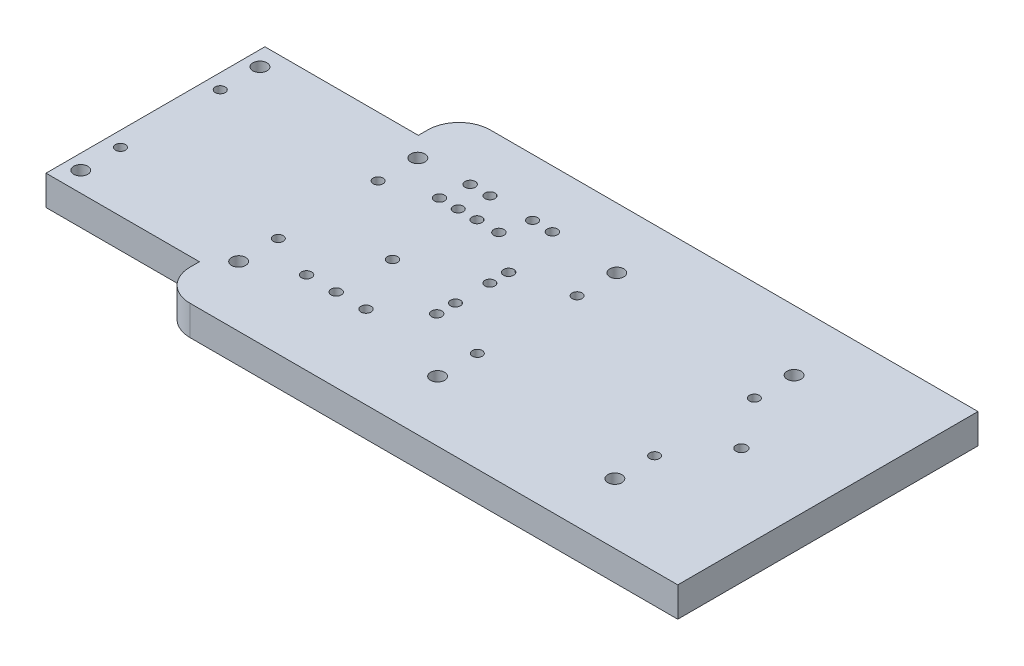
ISO-10303-21;
HEADER;
FILE_DESCRIPTION(('STEP AP214'),'2;1');
FILE_NAME('part.step','',(''),(''),'','','');
FILE_SCHEMA(('AUTOMOTIVE_DESIGN { 1 0 10303 214 1 1 1 1 }'));
ENDSEC;
DATA;
#1=APPLICATION_CONTEXT('core data for automotive mechanical design processes');
#2=APPLICATION_PROTOCOL_DEFINITION('international standard','automotive_design',2000,#1);
#3=PRODUCT_CONTEXT('',#1,'mechanical');
#4=PRODUCT('Part','Part','',(#3));
#5=PRODUCT_RELATED_PRODUCT_CATEGORY('part','',(#4));
#6=PRODUCT_DEFINITION_FORMATION('','',#4);
#7=PRODUCT_DEFINITION_CONTEXT('part definition',#1,'design');
#8=PRODUCT_DEFINITION('design','',#6,#7);
#9=PRODUCT_DEFINITION_SHAPE('','',#8);
#10=(LENGTH_UNIT() NAMED_UNIT(*) SI_UNIT(.MILLI.,.METRE.));
#11=(NAMED_UNIT(*) PLANE_ANGLE_UNIT() SI_UNIT($,.RADIAN.));
#12=(NAMED_UNIT(*) SI_UNIT($,.STERADIAN.) SOLID_ANGLE_UNIT());
#13=UNCERTAINTY_MEASURE_WITH_UNIT(LENGTH_MEASURE(1.E-05),#10,'distance_accuracy_value','');
#14=(GEOMETRIC_REPRESENTATION_CONTEXT(3) GLOBAL_UNCERTAINTY_ASSIGNED_CONTEXT((#13)) GLOBAL_UNIT_ASSIGNED_CONTEXT((#10,
#11,#12)) REPRESENTATION_CONTEXT('',''));
#15=CARTESIAN_POINT('',(0.,0.,0.));
#16=DIRECTION('',(0.,0.,1.));
#17=DIRECTION('',(1.,0.,0.));
#18=AXIS2_PLACEMENT_3D('',#15,#16,#17);
#19=CARTESIAN_POINT('',(0.,9.525,0.));
#20=DIRECTION('',(0.,1.,0.));
#21=DIRECTION('',(0.,0.,1.));
#22=AXIS2_PLACEMENT_3D('',#19,#20,#21);
#23=PLANE('',#22);
#24=DIRECTION('',(0.,0.,1.));
#25=VECTOR('',#24,1.);
#26=CARTESIAN_POINT('',(130.95,9.525,-48.));
#27=LINE('',#26,#25);
#28=CARTESIAN_POINT('',(130.95,9.525,-48.));
#29=VERTEX_POINT('',#28);
#30=CARTESIAN_POINT('',(130.95,9.525,48.));
#31=VERTEX_POINT('',#30);
#32=EDGE_CURVE('E52',#29,#31,#27,.T.);
#33=ORIENTED_EDGE('',*,*,#32,.F.);
#34=DIRECTION('',(1.,0.,0.));
#35=VECTOR('',#34,1.);
#36=CARTESIAN_POINT('',(-35.,9.525,-48.));
#37=LINE('',#36,#35);
#38=CARTESIAN_POINT('',(-25.,9.525,-48.));
#39=VERTEX_POINT('',#38);
#40=EDGE_CURVE('E131',#39,#29,#37,.T.);
#41=ORIENTED_EDGE('',*,*,#40,.F.);
#42=CARTESIAN_POINT('',(-25.,9.525,-38.));
#43=DIRECTION('',(0.,1.,0.));
#44=DIRECTION('',(0.,0.,1.));
#45=AXIS2_PLACEMENT_3D('',#42,#43,#44);
#46=CIRCLE('',#45,10.);
#47=CARTESIAN_POINT('',(-35.,9.525,-38.));
#48=VERTEX_POINT('',#47);
#49=EDGE_CURVE('E181',#39,#48,#46,.T.);
#50=ORIENTED_EDGE('',*,*,#49,.T.);
#51=DIRECTION('',(0.,0.,-1.));
#52=VECTOR('',#51,1.);
#53=CARTESIAN_POINT('',(-35.,9.525,-50.));
#54=LINE('',#53,#52);
#55=CARTESIAN_POINT('',(-35.,9.525,-35.));
#56=VERTEX_POINT('',#55);
#57=EDGE_CURVE('E169',#56,#48,#54,.T.);
#58=ORIENTED_EDGE('',*,*,#57,.F.);
#59=DIRECTION('',(1.,0.,0.));
#60=VECTOR('',#59,1.);
#61=CARTESIAN_POINT('',(-88.,9.525,-35.));
#62=LINE('',#61,#60);
#63=CARTESIAN_POINT('',(-84.05,9.525,-35.));
#64=VERTEX_POINT('',#63);
#65=EDGE_CURVE('E167',#64,#56,#62,.T.);
#66=ORIENTED_EDGE('',*,*,#65,.F.);
#67=DIRECTION('',(0.,0.,-1.));
#68=VECTOR('',#67,1.);
#69=CARTESIAN_POINT('',(-84.05,9.525,-35.));
#70=LINE('',#69,#68);
#71=CARTESIAN_POINT('',(-84.05,9.525,35.));
#72=VERTEX_POINT('',#71);
#73=EDGE_CURVE('E150',#72,#64,#70,.T.);
#74=ORIENTED_EDGE('',*,*,#73,.F.);
#75=DIRECTION('',(-1.,0.,0.));
#76=VECTOR('',#75,1.);
#77=CARTESIAN_POINT('',(-88.,9.525,35.));
#78=LINE('',#77,#76);
#79=CARTESIAN_POINT('',(-35.,9.525,35.));
#80=VERTEX_POINT('',#79);
#81=EDGE_CURVE('E159',#80,#72,#78,.T.);
#82=ORIENTED_EDGE('',*,*,#81,.F.);
#83=DIRECTION('',(0.,0.,-1.));
#84=VECTOR('',#83,1.);
#85=CARTESIAN_POINT('',(-35.,9.525,50.));
#86=LINE('',#85,#84);
#87=CARTESIAN_POINT('',(-35.,9.525,38.));
#88=VERTEX_POINT('',#87);
#89=EDGE_CURVE('E157',#88,#80,#86,.T.);
#90=ORIENTED_EDGE('',*,*,#89,.F.);
#91=CARTESIAN_POINT('',(-25.,9.525,38.));
#92=DIRECTION('',(0.,1.,0.));
#93=DIRECTION('',(0.,0.,1.));
#94=AXIS2_PLACEMENT_3D('',#91,#92,#93);
#95=CIRCLE('',#94,10.);
#96=CARTESIAN_POINT('',(-25.,9.525,48.));
#97=VERTEX_POINT('',#96);
#98=EDGE_CURVE('E183',#88,#97,#95,.T.);
#99=ORIENTED_EDGE('',*,*,#98,.T.);
#100=DIRECTION('',(-1.,0.,0.));
#101=VECTOR('',#100,1.);
#102=CARTESIAN_POINT('',(-35.,9.525,48.));
#103=LINE('',#102,#101);
#104=EDGE_CURVE('E133',#31,#97,#103,.T.);
#105=ORIENTED_EDGE('',*,*,#104,.F.);
#106=EDGE_LOOP('',(#33,#41,#50,#58,#66,#74,#82,#90,#99,#105));
#107=FACE_BOUND('',#106,.T.);
#108=CARTESIAN_POINT('',(6.80999999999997,9.525,-29.705));
#109=DIRECTION('',(0.,-1.,0.));
#110=DIRECTION('',(0.,0.,-1.));
#111=AXIS2_PLACEMENT_3D('',#108,#109,#110);
#112=CIRCLE('',#111,1.5875);
#113=CARTESIAN_POINT('',(6.80999999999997,9.525,-31.2925));
#114=VERTEX_POINT('',#113);
#115=EDGE_CURVE('E542',#114,#114,#112,.T.);
#116=ORIENTED_EDGE('',*,*,#115,.T.);
#117=EDGE_LOOP('',(#116));
#118=FACE_BOUND('',#117,.T.);
#119=CARTESIAN_POINT('',(-6.79000000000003,9.525,-29.705));
#120=DIRECTION('',(0.,-1.,0.));
#121=DIRECTION('',(0.,0.,-1.));
#122=AXIS2_PLACEMENT_3D('',#119,#120,#121);
#123=CIRCLE('',#122,1.5875);
#124=CARTESIAN_POINT('',(-6.79000000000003,9.525,-31.2925));
#125=VERTEX_POINT('',#124);
#126=EDGE_CURVE('E536',#125,#125,#123,.T.);
#127=ORIENTED_EDGE('',*,*,#126,.T.);
#128=EDGE_LOOP('',(#127));
#129=FACE_BOUND('',#128,.T.);
#130=CARTESIAN_POINT('',(-13.14,9.525,-29.705));
#131=DIRECTION('',(0.,-1.,0.));
#132=DIRECTION('',(0.,0.,-1.));
#133=AXIS2_PLACEMENT_3D('',#130,#131,#132);
#134=CIRCLE('',#133,1.63195);
#135=CARTESIAN_POINT('',(-13.14,9.525,-31.33695));
#136=VERTEX_POINT('',#135);
#137=EDGE_CURVE('E524',#136,#136,#134,.T.);
#138=ORIENTED_EDGE('',*,*,#137,.T.);
#139=EDGE_LOOP('',(#138));
#140=FACE_BOUND('',#139,.T.);
#141=CARTESIAN_POINT('',(13.16,9.525,-29.705));
#142=DIRECTION('',(0.,-1.,0.));
#143=DIRECTION('',(0.,0.,-1.));
#144=AXIS2_PLACEMENT_3D('',#141,#142,#143);
#145=CIRCLE('',#144,1.63195);
#146=CARTESIAN_POINT('',(13.16,9.525,-31.33695));
#147=VERTEX_POINT('',#146);
#148=EDGE_CURVE('E512',#147,#147,#145,.T.);
#149=ORIENTED_EDGE('',*,*,#148,.T.);
#150=EDGE_LOOP('',(#149));
#151=FACE_BOUND('',#150,.T.);
#152=CARTESIAN_POINT('',(-4.74000000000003,9.525,21.52));
#153=DIRECTION('',(0.,-1.,0.));
#154=DIRECTION('',(0.,0.,-1.));
#155=AXIS2_PLACEMENT_3D('',#152,#153,#154);
#156=CIRCLE('',#155,1.63195);
#157=CARTESIAN_POINT('',(-4.74000000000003,9.525,19.88805));
#158=VERTEX_POINT('',#157);
#159=EDGE_CURVE('E500',#158,#158,#156,.T.);
#160=ORIENTED_EDGE('',*,*,#159,.T.);
#161=EDGE_LOOP('',(#160));
#162=FACE_BOUND('',#161,.T.);
#163=CARTESIAN_POINT('',(-4.74000000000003,9.525,3.52000000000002));
#164=DIRECTION('',(0.,-1.,0.));
#165=DIRECTION('',(0.,0.,-1.));
#166=AXIS2_PLACEMENT_3D('',#163,#164,#165);
#167=CIRCLE('',#166,1.63195);
#168=CARTESIAN_POINT('',(-4.74000000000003,9.525,1.88805000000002));
#169=VERTEX_POINT('',#168);
#170=EDGE_CURVE('E488',#169,#169,#167,.T.);
#171=ORIENTED_EDGE('',*,*,#170,.T.);
#172=EDGE_LOOP('',(#171));
#173=FACE_BOUND('',#172,.T.);
#174=CARTESIAN_POINT('',(4.75999999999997,9.525,-21.));
#175=DIRECTION('',(0.,-1.,0.));
#176=DIRECTION('',(0.,0.,-1.));
#177=AXIS2_PLACEMENT_3D('',#174,#175,#176);
#178=CIRCLE('',#177,1.63195);
#179=CARTESIAN_POINT('',(4.75999999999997,9.525,-22.63195));
#180=VERTEX_POINT('',#179);
#181=EDGE_CURVE('E476',#180,#180,#178,.T.);
#182=ORIENTED_EDGE('',*,*,#181,.T.);
#183=EDGE_LOOP('',(#182));
#184=FACE_BOUND('',#183,.T.);
#185=CARTESIAN_POINT('',(-14.24,9.525,-21.));
#186=DIRECTION('',(0.,-1.,0.));
#187=DIRECTION('',(0.,0.,-1.));
#188=AXIS2_PLACEMENT_3D('',#185,#186,#187);
#189=CIRCLE('',#188,1.63195);
#190=CARTESIAN_POINT('',(-14.24,9.525,-22.63195));
#191=VERTEX_POINT('',#190);
#192=EDGE_CURVE('E464',#191,#191,#189,.T.);
#193=ORIENTED_EDGE('',*,*,#192,.T.);
#194=EDGE_LOOP('',(#193));
#195=FACE_BOUND('',#194,.T.);
#196=CARTESIAN_POINT('',(-14.24,9.525,21.5));
#197=DIRECTION('',(0.,-1.,0.));
#198=DIRECTION('',(0.,0.,-1.));
#199=AXIS2_PLACEMENT_3D('',#196,#197,#198);
#200=CIRCLE('',#199,1.63195);
#201=CARTESIAN_POINT('',(-14.24,9.525,19.86805));
#202=VERTEX_POINT('',#201);
#203=EDGE_CURVE('E452',#202,#202,#200,.T.);
#204=ORIENTED_EDGE('',*,*,#203,.T.);
#205=EDGE_LOOP('',(#204));
#206=FACE_BOUND('',#205,.T.);
#207=CARTESIAN_POINT('',(4.75999999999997,9.525,21.5));
#208=DIRECTION('',(0.,-1.,0.));
#209=DIRECTION('',(0.,0.,-1.));
#210=AXIS2_PLACEMENT_3D('',#207,#208,#209);
#211=CIRCLE('',#210,1.63195);
#212=CARTESIAN_POINT('',(4.75999999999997,9.525,19.86805));
#213=VERTEX_POINT('',#212);
#214=EDGE_CURVE('E440',#213,#213,#211,.T.);
#215=ORIENTED_EDGE('',*,*,#214,.T.);
#216=EDGE_LOOP('',(#215));
#217=FACE_BOUND('',#216,.T.);
#218=CARTESIAN_POINT('',(-2.24000000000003,9.525,-21.));
#219=DIRECTION('',(0.,-1.,0.));
#220=DIRECTION('',(0.,0.,-1.));
#221=AXIS2_PLACEMENT_3D('',#218,#219,#220);
#222=CIRCLE('',#221,1.5875);
#223=CARTESIAN_POINT('',(-2.24000000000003,9.525,-22.5875));
#224=VERTEX_POINT('',#223);
#225=EDGE_CURVE('E434',#224,#224,#222,.T.);
#226=ORIENTED_EDGE('',*,*,#225,.T.);
#227=EDGE_LOOP('',(#226));
#228=FACE_BOUND('',#227,.T.);
#229=CARTESIAN_POINT('',(-8.24000000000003,9.525,-21.));
#230=DIRECTION('',(0.,-1.,0.));
#231=DIRECTION('',(0.,0.,-1.));
#232=AXIS2_PLACEMENT_3D('',#229,#230,#231);
#233=CIRCLE('',#232,1.5875);
#234=CARTESIAN_POINT('',(-8.24000000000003,9.525,-22.5875));
#235=VERTEX_POINT('',#234);
#236=EDGE_CURVE('E428',#235,#235,#233,.T.);
#237=ORIENTED_EDGE('',*,*,#236,.T.);
#238=EDGE_LOOP('',(#237));
#239=FACE_BOUND('',#238,.T.);
#240=CARTESIAN_POINT('',(17.37,9.525,-5.5));
#241=DIRECTION('',(0.,-1.,0.));
#242=DIRECTION('',(0.,0.,-1.));
#243=AXIS2_PLACEMENT_3D('',#240,#241,#242);
#244=CIRCLE('',#243,1.5875);
#245=CARTESIAN_POINT('',(17.37,9.525,-7.0875));
#246=VERTEX_POINT('',#245);
#247=EDGE_CURVE('E422',#246,#246,#244,.T.);
#248=ORIENTED_EDGE('',*,*,#247,.T.);
#249=EDGE_LOOP('',(#248));
#250=FACE_BOUND('',#249,.T.);
#251=CARTESIAN_POINT('',(17.37,9.525,5.50000000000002));
#252=DIRECTION('',(0.,-1.,0.));
#253=DIRECTION('',(0.,0.,-1.));
#254=AXIS2_PLACEMENT_3D('',#251,#252,#253);
#255=CIRCLE('',#254,1.5875);
#256=CARTESIAN_POINT('',(17.37,9.525,3.91250000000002));
#257=VERTEX_POINT('',#256);
#258=EDGE_CURVE('E416',#257,#257,#255,.T.);
#259=ORIENTED_EDGE('',*,*,#258,.T.);
#260=EDGE_LOOP('',(#259));
#261=FACE_BOUND('',#260,.T.);
#262=CARTESIAN_POINT('',(17.37,9.525,-11.5));
#263=DIRECTION('',(0.,-1.,0.));
#264=DIRECTION('',(0.,0.,-1.));
#265=AXIS2_PLACEMENT_3D('',#262,#263,#264);
#266=CIRCLE('',#265,1.63195);
#267=CARTESIAN_POINT('',(17.37,9.525,-13.13195));
#268=VERTEX_POINT('',#267);
#269=EDGE_CURVE('E404',#268,#268,#266,.T.);
#270=ORIENTED_EDGE('',*,*,#269,.T.);
#271=EDGE_LOOP('',(#270));
#272=FACE_BOUND('',#271,.T.);
#273=CARTESIAN_POINT('',(17.37,9.525,11.5));
#274=DIRECTION('',(0.,-1.,0.));
#275=DIRECTION('',(0.,0.,-1.));
#276=AXIS2_PLACEMENT_3D('',#273,#274,#275);
#277=CIRCLE('',#276,1.63195);
#278=CARTESIAN_POINT('',(17.37,9.525,9.86805000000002));
#279=VERTEX_POINT('',#278);
#280=EDGE_CURVE('E392',#279,#279,#277,.T.);
#281=ORIENTED_EDGE('',*,*,#280,.T.);
#282=EDGE_LOOP('',(#281));
#283=FACE_BOUND('',#282,.T.);
#284=CARTESIAN_POINT('',(103.3,9.525,0.));
#285=DIRECTION('',(0.,1.,0.));
#286=DIRECTION('',(0.,0.,1.));
#287=AXIS2_PLACEMENT_3D('',#284,#285,#286);
#288=CIRCLE('',#287,1.72719999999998);
#289=CARTESIAN_POINT('',(103.3,9.525,1.72719999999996));
#290=VERTEX_POINT('',#289);
#291=EDGE_CURVE('E389',#290,#290,#288,.T.);
#292=ORIENTED_EDGE('',*,*,#291,.F.);
#293=EDGE_LOOP('',(#292));
#294=FACE_BOUND('',#293,.T.);
#295=CARTESIAN_POINT('',(-79.2875,9.525,15.95));
#296=DIRECTION('',(0.,1.,0.));
#297=DIRECTION('',(0.,0.,1.));
#298=AXIS2_PLACEMENT_3D('',#295,#296,#297);
#299=CIRCLE('',#298,1.58750000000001);
#300=CARTESIAN_POINT('',(-79.2875,9.525,17.5375));
#301=VERTEX_POINT('',#300);
#302=EDGE_CURVE('E383',#301,#301,#299,.T.);
#303=ORIENTED_EDGE('',*,*,#302,.F.);
#304=EDGE_LOOP('',(#303));
#305=FACE_BOUND('',#304,.T.);
#306=CARTESIAN_POINT('',(-79.2875,9.525,-15.95));
#307=DIRECTION('',(0.,1.,0.));
#308=DIRECTION('',(0.,0.,1.));
#309=AXIS2_PLACEMENT_3D('',#306,#307,#308);
#310=CIRCLE('',#309,1.58749999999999);
#311=CARTESIAN_POINT('',(-79.2875,9.525,-14.3625));
#312=VERTEX_POINT('',#311);
#313=EDGE_CURVE('E377',#312,#312,#310,.T.);
#314=ORIENTED_EDGE('',*,*,#313,.F.);
#315=EDGE_LOOP('',(#314));
#316=FACE_BOUND('',#315,.T.);
#317=CARTESIAN_POINT('',(-28.8075,9.525,-15.95));
#318=DIRECTION('',(0.,1.,0.));
#319=DIRECTION('',(0.,0.,1.));
#320=AXIS2_PLACEMENT_3D('',#317,#318,#319);
#321=CIRCLE('',#320,1.5875);
#322=CARTESIAN_POINT('',(-28.8075,9.525,-14.3625));
#323=VERTEX_POINT('',#322);
#324=EDGE_CURVE('E371',#323,#323,#321,.T.);
#325=ORIENTED_EDGE('',*,*,#324,.F.);
#326=EDGE_LOOP('',(#325));
#327=FACE_BOUND('',#326,.T.);
#328=CARTESIAN_POINT('',(-28.8075,9.525,15.95));
#329=DIRECTION('',(0.,1.,0.));
#330=DIRECTION('',(0.,0.,1.));
#331=AXIS2_PLACEMENT_3D('',#328,#329,#330);
#332=CIRCLE('',#331,1.5875);
#333=CARTESIAN_POINT('',(-28.8075,9.525,17.5375));
#334=VERTEX_POINT('',#333);
#335=EDGE_CURVE('E365',#334,#334,#332,.T.);
#336=ORIENTED_EDGE('',*,*,#335,.F.);
#337=EDGE_LOOP('',(#336));
#338=FACE_BOUND('',#337,.T.);
#339=CARTESIAN_POINT('',(34.81,9.525,-15.95));
#340=DIRECTION('',(0.,1.,0.));
#341=DIRECTION('',(0.,0.,1.));
#342=AXIS2_PLACEMENT_3D('',#339,#340,#341);
#343=CIRCLE('',#342,1.5875);
#344=CARTESIAN_POINT('',(34.81,9.525,-14.3625));
#345=VERTEX_POINT('',#344);
#346=EDGE_CURVE('E359',#345,#345,#343,.T.);
#347=ORIENTED_EDGE('',*,*,#346,.F.);
#348=EDGE_LOOP('',(#347));
#349=FACE_BOUND('',#348,.T.);
#350=CARTESIAN_POINT('',(34.81,9.525,15.95));
#351=DIRECTION('',(0.,1.,0.));
#352=DIRECTION('',(0.,0.,1.));
#353=AXIS2_PLACEMENT_3D('',#350,#351,#352);
#354=CIRCLE('',#353,1.5875);
#355=CARTESIAN_POINT('',(34.81,9.525,17.5375));
#356=VERTEX_POINT('',#355);
#357=EDGE_CURVE('E353',#356,#356,#354,.T.);
#358=ORIENTED_EDGE('',*,*,#357,.F.);
#359=EDGE_LOOP('',(#358));
#360=FACE_BOUND('',#359,.T.);
#361=CARTESIAN_POINT('',(91.49,9.525,15.95));
#362=DIRECTION('',(0.,1.,0.));
#363=DIRECTION('',(0.,0.,1.));
#364=AXIS2_PLACEMENT_3D('',#361,#362,#363);
#365=CIRCLE('',#364,1.58749999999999);
#366=CARTESIAN_POINT('',(91.49,9.525,17.5375));
#367=VERTEX_POINT('',#366);
#368=EDGE_CURVE('E347',#367,#367,#365,.T.);
#369=ORIENTED_EDGE('',*,*,#368,.F.);
#370=EDGE_LOOP('',(#369));
#371=FACE_BOUND('',#370,.T.);
#372=CARTESIAN_POINT('',(91.49,9.525,-15.95));
#373=DIRECTION('',(0.,1.,0.));
#374=DIRECTION('',(0.,0.,1.));
#375=AXIS2_PLACEMENT_3D('',#372,#373,#374);
#376=CIRCLE('',#375,1.58749999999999);
#377=CARTESIAN_POINT('',(91.49,9.525,-14.3625));
#378=VERTEX_POINT('',#377);
#379=EDGE_CURVE('E341',#378,#378,#376,.T.);
#380=ORIENTED_EDGE('',*,*,#379,.F.);
#381=EDGE_LOOP('',(#380));
#382=FACE_BOUND('',#381,.T.);
#383=CARTESIAN_POINT('',(-79.2875,9.525,28.65));
#384=DIRECTION('',(0.,-1.,0.));
#385=DIRECTION('',(0.,0.,-1.));
#386=AXIS2_PLACEMENT_3D('',#383,#384,#385);
#387=CIRCLE('',#386,2.2479);
#388=CARTESIAN_POINT('',(-79.2875,9.525,26.4021));
#389=VERTEX_POINT('',#388);
#390=EDGE_CURVE('E326',#389,#389,#387,.T.);
#391=ORIENTED_EDGE('',*,*,#390,.T.);
#392=EDGE_LOOP('',(#391));
#393=FACE_BOUND('',#392,.T.);
#394=CARTESIAN_POINT('',(-79.2875,9.525,-28.65));
#395=DIRECTION('',(0.,-1.,0.));
#396=DIRECTION('',(0.,0.,-1.));
#397=AXIS2_PLACEMENT_3D('',#394,#395,#396);
#398=CIRCLE('',#397,2.2479);
#399=CARTESIAN_POINT('',(-79.2875,9.525,-30.8979));
#400=VERTEX_POINT('',#399);
#401=EDGE_CURVE('E314',#400,#400,#398,.T.);
#402=ORIENTED_EDGE('',*,*,#401,.T.);
#403=EDGE_LOOP('',(#402));
#404=FACE_BOUND('',#403,.T.);
#405=CARTESIAN_POINT('',(-28.8075,9.525,28.65));
#406=DIRECTION('',(0.,-1.,0.));
#407=DIRECTION('',(0.,0.,-1.));
#408=AXIS2_PLACEMENT_3D('',#405,#406,#407);
#409=CIRCLE('',#408,2.2479);
#410=CARTESIAN_POINT('',(-28.8075,9.525,26.4021));
#411=VERTEX_POINT('',#410);
#412=EDGE_CURVE('E302',#411,#411,#409,.T.);
#413=ORIENTED_EDGE('',*,*,#412,.T.);
#414=EDGE_LOOP('',(#413));
#415=FACE_BOUND('',#414,.T.);
#416=CARTESIAN_POINT('',(-28.8075,9.525,-28.65));
#417=DIRECTION('',(0.,-1.,0.));
#418=DIRECTION('',(0.,0.,-1.));
#419=AXIS2_PLACEMENT_3D('',#416,#417,#418);
#420=CIRCLE('',#419,2.2479);
#421=CARTESIAN_POINT('',(-28.8075,9.525,-30.8979));
#422=VERTEX_POINT('',#421);
#423=EDGE_CURVE('E290',#422,#422,#420,.T.);
#424=ORIENTED_EDGE('',*,*,#423,.T.);
#425=EDGE_LOOP('',(#424));
#426=FACE_BOUND('',#425,.T.);
#427=CARTESIAN_POINT('',(34.81,9.525,28.65));
#428=DIRECTION('',(0.,-1.,0.));
#429=DIRECTION('',(0.,0.,-1.));
#430=AXIS2_PLACEMENT_3D('',#427,#428,#429);
#431=CIRCLE('',#430,2.2479);
#432=CARTESIAN_POINT('',(34.81,9.525,26.4021));
#433=VERTEX_POINT('',#432);
#434=EDGE_CURVE('E278',#433,#433,#431,.T.);
#435=ORIENTED_EDGE('',*,*,#434,.T.);
#436=EDGE_LOOP('',(#435));
#437=FACE_BOUND('',#436,.T.);
#438=CARTESIAN_POINT('',(91.49,9.525,28.65));
#439=DIRECTION('',(0.,-1.,0.));
#440=DIRECTION('',(0.,0.,-1.));
#441=AXIS2_PLACEMENT_3D('',#438,#439,#440);
#442=CIRCLE('',#441,2.2479);
#443=CARTESIAN_POINT('',(91.49,9.525,26.4021));
#444=VERTEX_POINT('',#443);
#445=EDGE_CURVE('E266',#444,#444,#442,.T.);
#446=ORIENTED_EDGE('',*,*,#445,.T.);
#447=EDGE_LOOP('',(#446));
#448=FACE_BOUND('',#447,.T.);
#449=CARTESIAN_POINT('',(91.49,9.525,-28.65));
#450=DIRECTION('',(0.,-1.,0.));
#451=DIRECTION('',(0.,0.,-1.));
#452=AXIS2_PLACEMENT_3D('',#449,#450,#451);
#453=CIRCLE('',#452,2.2479);
#454=CARTESIAN_POINT('',(91.49,9.525,-30.8979));
#455=VERTEX_POINT('',#454);
#456=EDGE_CURVE('E254',#455,#455,#453,.T.);
#457=ORIENTED_EDGE('',*,*,#456,.T.);
#458=EDGE_LOOP('',(#457));
#459=FACE_BOUND('',#458,.T.);
#460=CARTESIAN_POINT('',(34.81,9.525,-28.65));
#461=DIRECTION('',(0.,-1.,0.));
#462=DIRECTION('',(0.,0.,-1.));
#463=AXIS2_PLACEMENT_3D('',#460,#461,#462);
#464=CIRCLE('',#463,2.2479);
#465=CARTESIAN_POINT('',(34.81,9.525,-30.8979));
#466=VERTEX_POINT('',#465);
#467=EDGE_CURVE('E242',#466,#466,#464,.T.);
#468=ORIENTED_EDGE('',*,*,#467,.T.);
#469=EDGE_LOOP('',(#468));
#470=FACE_BOUND('',#469,.T.);
#471=ADVANCED_FACE('F37',(#107,#118,#129,#140,#151,#162,#173,#184,#195,#206,#217,#228,#239,#250,
#261,#272,#283,#294,#305,#316,#327,#338,#349,#360,#371,#382,#393,#404,#415,#426,#437,#448,#459,
#470),#23,.T.);
#472=CARTESIAN_POINT('',(0.,0.,0.));
#473=DIRECTION('',(0.,1.,0.));
#474=DIRECTION('',(0.,0.,1.));
#475=AXIS2_PLACEMENT_3D('',#472,#473,#474);
#476=PLANE('',#475);
#477=CARTESIAN_POINT('',(6.80999999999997,0.,-29.705));
#478=DIRECTION('',(0.,-1.,0.));
#479=DIRECTION('',(0.,0.,-1.));
#480=AXIS2_PLACEMENT_3D('',#477,#478,#479);
#481=CIRCLE('',#480,1.5875);
#482=CARTESIAN_POINT('',(6.80999999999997,0.,-31.2925));
#483=VERTEX_POINT('',#482);
#484=EDGE_CURVE('E545',#483,#483,#481,.T.);
#485=ORIENTED_EDGE('',*,*,#484,.F.);
#486=EDGE_LOOP('',(#485));
#487=FACE_BOUND('',#486,.T.);
#488=CARTESIAN_POINT('',(-6.79000000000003,0.,-29.705));
#489=DIRECTION('',(0.,-1.,0.));
#490=DIRECTION('',(0.,0.,-1.));
#491=AXIS2_PLACEMENT_3D('',#488,#489,#490);
#492=CIRCLE('',#491,1.5875);
#493=CARTESIAN_POINT('',(-6.79000000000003,0.,-31.2925));
#494=VERTEX_POINT('',#493);
#495=EDGE_CURVE('E539',#494,#494,#492,.T.);
#496=ORIENTED_EDGE('',*,*,#495,.F.);
#497=EDGE_LOOP('',(#496));
#498=FACE_BOUND('',#497,.T.);
#499=CARTESIAN_POINT('',(-13.14,0.,-29.705));
#500=DIRECTION('',(0.,-1.,0.));
#501=DIRECTION('',(0.,0.,-1.));
#502=AXIS2_PLACEMENT_3D('',#499,#500,#501);
#503=CIRCLE('',#502,2.77875999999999);
#504=CARTESIAN_POINT('',(-13.14,0.,-32.48376));
#505=VERTEX_POINT('',#504);
#506=EDGE_CURVE('E533',#505,#505,#503,.T.);
#507=ORIENTED_EDGE('',*,*,#506,.F.);
#508=EDGE_LOOP('',(#507));
#509=FACE_BOUND('',#508,.T.);
#510=CARTESIAN_POINT('',(13.16,0.,-29.705));
#511=DIRECTION('',(0.,-1.,0.));
#512=DIRECTION('',(0.,0.,-1.));
#513=AXIS2_PLACEMENT_3D('',#510,#511,#512);
#514=CIRCLE('',#513,2.77875999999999);
#515=CARTESIAN_POINT('',(13.16,0.,-32.48376));
#516=VERTEX_POINT('',#515);
#517=EDGE_CURVE('E521',#516,#516,#514,.T.);
#518=ORIENTED_EDGE('',*,*,#517,.F.);
#519=EDGE_LOOP('',(#518));
#520=FACE_BOUND('',#519,.T.);
#521=CARTESIAN_POINT('',(-4.74000000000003,0.,21.52));
#522=DIRECTION('',(0.,-1.,0.));
#523=DIRECTION('',(0.,0.,-1.));
#524=AXIS2_PLACEMENT_3D('',#521,#522,#523);
#525=CIRCLE('',#524,2.77875999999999);
#526=CARTESIAN_POINT('',(-4.74000000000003,0.,18.74124));
#527=VERTEX_POINT('',#526);
#528=EDGE_CURVE('E509',#527,#527,#525,.T.);
#529=ORIENTED_EDGE('',*,*,#528,.F.);
#530=EDGE_LOOP('',(#529));
#531=FACE_BOUND('',#530,.T.);
#532=CARTESIAN_POINT('',(-4.74000000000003,0.,3.52000000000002));
#533=DIRECTION('',(0.,-1.,0.));
#534=DIRECTION('',(0.,0.,-1.));
#535=AXIS2_PLACEMENT_3D('',#532,#533,#534);
#536=CIRCLE('',#535,2.77875999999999);
#537=CARTESIAN_POINT('',(-4.74000000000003,0.,0.741240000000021));
#538=VERTEX_POINT('',#537);
#539=EDGE_CURVE('E497',#538,#538,#536,.T.);
#540=ORIENTED_EDGE('',*,*,#539,.F.);
#541=EDGE_LOOP('',(#540));
#542=FACE_BOUND('',#541,.T.);
#543=CARTESIAN_POINT('',(4.75999999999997,0.,-21.));
#544=DIRECTION('',(0.,-1.,0.));
#545=DIRECTION('',(0.,0.,-1.));
#546=AXIS2_PLACEMENT_3D('',#543,#544,#545);
#547=CIRCLE('',#546,2.77875999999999);
#548=CARTESIAN_POINT('',(4.75999999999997,0.,-23.77876));
#549=VERTEX_POINT('',#548);
#550=EDGE_CURVE('E485',#549,#549,#547,.T.);
#551=ORIENTED_EDGE('',*,*,#550,.F.);
#552=EDGE_LOOP('',(#551));
#553=FACE_BOUND('',#552,.T.);
#554=CARTESIAN_POINT('',(-14.24,0.,-21.));
#555=DIRECTION('',(0.,-1.,0.));
#556=DIRECTION('',(0.,0.,-1.));
#557=AXIS2_PLACEMENT_3D('',#554,#555,#556);
#558=CIRCLE('',#557,2.77875999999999);
#559=CARTESIAN_POINT('',(-14.24,0.,-23.77876));
#560=VERTEX_POINT('',#559);
#561=EDGE_CURVE('E473',#560,#560,#558,.T.);
#562=ORIENTED_EDGE('',*,*,#561,.F.);
#563=EDGE_LOOP('',(#562));
#564=FACE_BOUND('',#563,.T.);
#565=CARTESIAN_POINT('',(-14.24,0.,21.5));
#566=DIRECTION('',(0.,-1.,0.));
#567=DIRECTION('',(0.,0.,-1.));
#568=AXIS2_PLACEMENT_3D('',#565,#566,#567);
#569=CIRCLE('',#568,2.77875999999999);
#570=CARTESIAN_POINT('',(-14.24,0.,18.72124));
#571=VERTEX_POINT('',#570);
#572=EDGE_CURVE('E461',#571,#571,#569,.T.);
#573=ORIENTED_EDGE('',*,*,#572,.F.);
#574=EDGE_LOOP('',(#573));
#575=FACE_BOUND('',#574,.T.);
#576=CARTESIAN_POINT('',(4.75999999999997,0.,21.5));
#577=DIRECTION('',(0.,-1.,0.));
#578=DIRECTION('',(0.,0.,-1.));
#579=AXIS2_PLACEMENT_3D('',#576,#577,#578);
#580=CIRCLE('',#579,2.77875999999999);
#581=CARTESIAN_POINT('',(4.75999999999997,0.,18.72124));
#582=VERTEX_POINT('',#581);
#583=EDGE_CURVE('E449',#582,#582,#580,.T.);
#584=ORIENTED_EDGE('',*,*,#583,.F.);
#585=EDGE_LOOP('',(#584));
#586=FACE_BOUND('',#585,.T.);
#587=CARTESIAN_POINT('',(-2.24000000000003,0.,-21.));
#588=DIRECTION('',(0.,-1.,0.));
#589=DIRECTION('',(0.,0.,-1.));
#590=AXIS2_PLACEMENT_3D('',#587,#588,#589);
#591=CIRCLE('',#590,1.58749999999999);
#592=CARTESIAN_POINT('',(-2.24000000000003,0.,-22.5875));
#593=VERTEX_POINT('',#592);
#594=EDGE_CURVE('E437',#593,#593,#591,.T.);
#595=ORIENTED_EDGE('',*,*,#594,.F.);
#596=EDGE_LOOP('',(#595));
#597=FACE_BOUND('',#596,.T.);
#598=CARTESIAN_POINT('',(-8.24000000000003,0.,-21.));
#599=DIRECTION('',(0.,-1.,0.));
#600=DIRECTION('',(0.,0.,-1.));
#601=AXIS2_PLACEMENT_3D('',#598,#599,#600);
#602=CIRCLE('',#601,1.58749999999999);
#603=CARTESIAN_POINT('',(-8.24000000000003,0.,-22.5875));
#604=VERTEX_POINT('',#603);
#605=EDGE_CURVE('E431',#604,#604,#602,.T.);
#606=ORIENTED_EDGE('',*,*,#605,.F.);
#607=EDGE_LOOP('',(#606));
#608=FACE_BOUND('',#607,.T.);
#609=CARTESIAN_POINT('',(17.37,0.,-5.5));
#610=DIRECTION('',(0.,-1.,0.));
#611=DIRECTION('',(0.,0.,-1.));
#612=AXIS2_PLACEMENT_3D('',#609,#610,#611);
#613=CIRCLE('',#612,1.5875);
#614=CARTESIAN_POINT('',(17.37,0.,-7.0875));
#615=VERTEX_POINT('',#614);
#616=EDGE_CURVE('E425',#615,#615,#613,.T.);
#617=ORIENTED_EDGE('',*,*,#616,.F.);
#618=EDGE_LOOP('',(#617));
#619=FACE_BOUND('',#618,.T.);
#620=CARTESIAN_POINT('',(17.37,0.,5.50000000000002));
#621=DIRECTION('',(0.,-1.,0.));
#622=DIRECTION('',(0.,0.,-1.));
#623=AXIS2_PLACEMENT_3D('',#620,#621,#622);
#624=CIRCLE('',#623,1.5875);
#625=CARTESIAN_POINT('',(17.37,0.,3.91250000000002));
#626=VERTEX_POINT('',#625);
#627=EDGE_CURVE('E419',#626,#626,#624,.T.);
#628=ORIENTED_EDGE('',*,*,#627,.F.);
#629=EDGE_LOOP('',(#628));
#630=FACE_BOUND('',#629,.T.);
#631=CARTESIAN_POINT('',(17.37,0.,-11.5));
#632=DIRECTION('',(0.,-1.,0.));
#633=DIRECTION('',(0.,0.,-1.));
#634=AXIS2_PLACEMENT_3D('',#631,#632,#633);
#635=CIRCLE('',#634,2.77875999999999);
#636=CARTESIAN_POINT('',(17.37,0.,-14.27876));
#637=VERTEX_POINT('',#636);
#638=EDGE_CURVE('E413',#637,#637,#635,.T.);
#639=ORIENTED_EDGE('',*,*,#638,.F.);
#640=EDGE_LOOP('',(#639));
#641=FACE_BOUND('',#640,.T.);
#642=CARTESIAN_POINT('',(17.37,0.,11.5));
#643=DIRECTION('',(0.,-1.,0.));
#644=DIRECTION('',(0.,0.,-1.));
#645=AXIS2_PLACEMENT_3D('',#642,#643,#644);
#646=CIRCLE('',#645,2.77875999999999);
#647=CARTESIAN_POINT('',(17.37,0.,8.72124000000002));
#648=VERTEX_POINT('',#647);
#649=EDGE_CURVE('E401',#648,#648,#646,.T.);
#650=ORIENTED_EDGE('',*,*,#649,.F.);
#651=EDGE_LOOP('',(#650));
#652=FACE_BOUND('',#651,.T.);
#653=CARTESIAN_POINT('',(-79.2875,0.,15.95));
#654=DIRECTION('',(0.,1.,0.));
#655=DIRECTION('',(0.,0.,1.));
#656=AXIS2_PLACEMENT_3D('',#653,#654,#655);
#657=CIRCLE('',#656,1.58749999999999);
#658=CARTESIAN_POINT('',(-79.2875,0.,17.5375));
#659=VERTEX_POINT('',#658);
#660=EDGE_CURVE('E380',#659,#659,#657,.T.);
#661=ORIENTED_EDGE('',*,*,#660,.T.);
#662=EDGE_LOOP('',(#661));
#663=FACE_BOUND('',#662,.T.);
#664=CARTESIAN_POINT('',(-79.2875,0.,-15.95));
#665=DIRECTION('',(0.,1.,0.));
#666=DIRECTION('',(0.,0.,1.));
#667=AXIS2_PLACEMENT_3D('',#664,#665,#666);
#668=CIRCLE('',#667,1.58749999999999);
#669=CARTESIAN_POINT('',(-79.2875,0.,-14.3625));
#670=VERTEX_POINT('',#669);
#671=EDGE_CURVE('E374',#670,#670,#668,.T.);
#672=ORIENTED_EDGE('',*,*,#671,.T.);
#673=EDGE_LOOP('',(#672));
#674=FACE_BOUND('',#673,.T.);
#675=CARTESIAN_POINT('',(-28.8075,0.,-15.95));
#676=DIRECTION('',(0.,1.,0.));
#677=DIRECTION('',(0.,0.,1.));
#678=AXIS2_PLACEMENT_3D('',#675,#676,#677);
#679=CIRCLE('',#678,1.5875);
#680=CARTESIAN_POINT('',(-28.8075,0.,-14.3625));
#681=VERTEX_POINT('',#680);
#682=EDGE_CURVE('E368',#681,#681,#679,.T.);
#683=ORIENTED_EDGE('',*,*,#682,.T.);
#684=EDGE_LOOP('',(#683));
#685=FACE_BOUND('',#684,.T.);
#686=CARTESIAN_POINT('',(-28.8075,0.,15.95));
#687=DIRECTION('',(0.,1.,0.));
#688=DIRECTION('',(0.,0.,1.));
#689=AXIS2_PLACEMENT_3D('',#686,#687,#688);
#690=CIRCLE('',#689,1.5875);
#691=CARTESIAN_POINT('',(-28.8075,0.,17.5375));
#692=VERTEX_POINT('',#691);
#693=EDGE_CURVE('E362',#692,#692,#690,.T.);
#694=ORIENTED_EDGE('',*,*,#693,.T.);
#695=EDGE_LOOP('',(#694));
#696=FACE_BOUND('',#695,.T.);
#697=CARTESIAN_POINT('',(34.81,0.,-15.95));
#698=DIRECTION('',(0.,1.,0.));
#699=DIRECTION('',(0.,0.,1.));
#700=AXIS2_PLACEMENT_3D('',#697,#698,#699);
#701=CIRCLE('',#700,1.5875);
#702=CARTESIAN_POINT('',(34.81,0.,-14.3625));
#703=VERTEX_POINT('',#702);
#704=EDGE_CURVE('E356',#703,#703,#701,.T.);
#705=ORIENTED_EDGE('',*,*,#704,.T.);
#706=EDGE_LOOP('',(#705));
#707=FACE_BOUND('',#706,.T.);
#708=CARTESIAN_POINT('',(34.81,0.,15.95));
#709=DIRECTION('',(0.,1.,0.));
#710=DIRECTION('',(0.,0.,1.));
#711=AXIS2_PLACEMENT_3D('',#708,#709,#710);
#712=CIRCLE('',#711,1.5875);
#713=CARTESIAN_POINT('',(34.81,0.,17.5375));
#714=VERTEX_POINT('',#713);
#715=EDGE_CURVE('E350',#714,#714,#712,.T.);
#716=ORIENTED_EDGE('',*,*,#715,.T.);
#717=EDGE_LOOP('',(#716));
#718=FACE_BOUND('',#717,.T.);
#719=CARTESIAN_POINT('',(91.49,0.,15.95));
#720=DIRECTION('',(0.,1.,0.));
#721=DIRECTION('',(0.,0.,1.));
#722=AXIS2_PLACEMENT_3D('',#719,#720,#721);
#723=CIRCLE('',#722,1.58749999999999);
#724=CARTESIAN_POINT('',(91.49,0.,17.5375));
#725=VERTEX_POINT('',#724);
#726=EDGE_CURVE('E344',#725,#725,#723,.T.);
#727=ORIENTED_EDGE('',*,*,#726,.T.);
#728=EDGE_LOOP('',(#727));
#729=FACE_BOUND('',#728,.T.);
#730=CARTESIAN_POINT('',(91.49,0.,-15.95));
#731=DIRECTION('',(0.,1.,0.));
#732=DIRECTION('',(0.,0.,1.));
#733=AXIS2_PLACEMENT_3D('',#730,#731,#732);
#734=CIRCLE('',#733,1.58749999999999);
#735=CARTESIAN_POINT('',(91.49,0.,-14.3625));
#736=VERTEX_POINT('',#735);
#737=EDGE_CURVE('E338',#736,#736,#734,.T.);
#738=ORIENTED_EDGE('',*,*,#737,.T.);
#739=EDGE_LOOP('',(#738));
#740=FACE_BOUND('',#739,.T.);
#741=CARTESIAN_POINT('',(-79.2875,0.,28.65));
#742=DIRECTION('',(0.,-1.,0.));
#743=DIRECTION('',(0.,0.,-1.));
#744=AXIS2_PLACEMENT_3D('',#741,#742,#743);
#745=CIRCLE('',#744,3.96875000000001);
#746=CARTESIAN_POINT('',(-79.2875,0.,24.68125));
#747=VERTEX_POINT('',#746);
#748=EDGE_CURVE('E335',#747,#747,#745,.T.);
#749=ORIENTED_EDGE('',*,*,#748,.F.);
#750=EDGE_LOOP('',(#749));
#751=FACE_BOUND('',#750,.T.);
#752=CARTESIAN_POINT('',(-79.2875,0.,-28.65));
#753=DIRECTION('',(0.,-1.,0.));
#754=DIRECTION('',(0.,0.,-1.));
#755=AXIS2_PLACEMENT_3D('',#752,#753,#754);
#756=CIRCLE('',#755,3.96874999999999);
#757=CARTESIAN_POINT('',(-79.2875,0.,-32.61875));
#758=VERTEX_POINT('',#757);
#759=EDGE_CURVE('E323',#758,#758,#756,.T.);
#760=ORIENTED_EDGE('',*,*,#759,.F.);
#761=EDGE_LOOP('',(#760));
#762=FACE_BOUND('',#761,.T.);
#763=CARTESIAN_POINT('',(-28.8075,0.,28.65));
#764=DIRECTION('',(0.,-1.,0.));
#765=DIRECTION('',(0.,0.,-1.));
#766=AXIS2_PLACEMENT_3D('',#763,#764,#765);
#767=CIRCLE('',#766,3.96875);
#768=CARTESIAN_POINT('',(-28.8075,0.,24.68125));
#769=VERTEX_POINT('',#768);
#770=EDGE_CURVE('E311',#769,#769,#767,.T.);
#771=ORIENTED_EDGE('',*,*,#770,.F.);
#772=EDGE_LOOP('',(#771));
#773=FACE_BOUND('',#772,.T.);
#774=CARTESIAN_POINT('',(-28.8075,0.,-28.65));
#775=DIRECTION('',(0.,-1.,0.));
#776=DIRECTION('',(0.,0.,-1.));
#777=AXIS2_PLACEMENT_3D('',#774,#775,#776);
#778=CIRCLE('',#777,3.96875);
#779=CARTESIAN_POINT('',(-28.8075,0.,-32.61875));
#780=VERTEX_POINT('',#779);
#781=EDGE_CURVE('E299',#780,#780,#778,.T.);
#782=ORIENTED_EDGE('',*,*,#781,.F.);
#783=EDGE_LOOP('',(#782));
#784=FACE_BOUND('',#783,.T.);
#785=CARTESIAN_POINT('',(34.81,0.,28.65));
#786=DIRECTION('',(0.,-1.,0.));
#787=DIRECTION('',(0.,0.,-1.));
#788=AXIS2_PLACEMENT_3D('',#785,#786,#787);
#789=CIRCLE('',#788,3.96875);
#790=CARTESIAN_POINT('',(34.81,0.,24.68125));
#791=VERTEX_POINT('',#790);
#792=EDGE_CURVE('E287',#791,#791,#789,.T.);
#793=ORIENTED_EDGE('',*,*,#792,.F.);
#794=EDGE_LOOP('',(#793));
#795=FACE_BOUND('',#794,.T.);
#796=CARTESIAN_POINT('',(91.49,0.,28.65));
#797=DIRECTION('',(0.,-1.,0.));
#798=DIRECTION('',(0.,0.,-1.));
#799=AXIS2_PLACEMENT_3D('',#796,#797,#798);
#800=CIRCLE('',#799,3.96874999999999);
#801=CARTESIAN_POINT('',(91.49,0.,24.68125));
#802=VERTEX_POINT('',#801);
#803=EDGE_CURVE('E275',#802,#802,#800,.T.);
#804=ORIENTED_EDGE('',*,*,#803,.F.);
#805=EDGE_LOOP('',(#804));
#806=FACE_BOUND('',#805,.T.);
#807=CARTESIAN_POINT('',(91.49,0.,-28.65));
#808=DIRECTION('',(0.,-1.,0.));
#809=DIRECTION('',(0.,0.,-1.));
#810=AXIS2_PLACEMENT_3D('',#807,#808,#809);
#811=CIRCLE('',#810,3.96874999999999);
#812=CARTESIAN_POINT('',(91.49,0.,-32.61875));
#813=VERTEX_POINT('',#812);
#814=EDGE_CURVE('E263',#813,#813,#811,.T.);
#815=ORIENTED_EDGE('',*,*,#814,.F.);
#816=EDGE_LOOP('',(#815));
#817=FACE_BOUND('',#816,.T.);
#818=CARTESIAN_POINT('',(34.81,0.,-28.65));
#819=DIRECTION('',(0.,-1.,0.));
#820=DIRECTION('',(0.,0.,-1.));
#821=AXIS2_PLACEMENT_3D('',#818,#819,#820);
#822=CIRCLE('',#821,3.96875);
#823=CARTESIAN_POINT('',(34.81,0.,-32.61875));
#824=VERTEX_POINT('',#823);
#825=EDGE_CURVE('E251',#824,#824,#822,.T.);
#826=ORIENTED_EDGE('',*,*,#825,.F.);
#827=EDGE_LOOP('',(#826));
#828=FACE_BOUND('',#827,.T.);
#829=CARTESIAN_POINT('',(-54.05,0.,0.));
#830=DIRECTION('',(0.,-1.,0.));
#831=DIRECTION('',(0.,0.,-1.));
#832=AXIS2_PLACEMENT_3D('',#829,#830,#831);
#833=CIRCLE('',#832,1.72719999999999);
#834=CARTESIAN_POINT('',(-54.05,0.,-1.72719999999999));
#835=VERTEX_POINT('',#834);
#836=EDGE_CURVE('E239',#835,#835,#833,.T.);
#837=ORIENTED_EDGE('',*,*,#836,.F.);
#838=EDGE_LOOP('',(#837));
#839=FACE_BOUND('',#838,.T.);
#840=CARTESIAN_POINT('',(73.25,0.,0.));
#841=DIRECTION('',(0.,-1.,0.));
#842=DIRECTION('',(0.,0.,-1.));
#843=AXIS2_PLACEMENT_3D('',#840,#841,#842);
#844=CIRCLE('',#843,1.72719999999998);
#845=CARTESIAN_POINT('',(73.25,0.,-1.72719999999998));
#846=VERTEX_POINT('',#845);
#847=EDGE_CURVE('E231',#846,#846,#844,.T.);
#848=ORIENTED_EDGE('',*,*,#847,.F.);
#849=EDGE_LOOP('',(#848));
#850=FACE_BOUND('',#849,.T.);
#851=DIRECTION('',(-1.,0.,0.));
#852=VECTOR('',#851,1.);
#853=CARTESIAN_POINT('',(-35.,0.,-48.));
#854=LINE('',#853,#852);
#855=CARTESIAN_POINT('',(130.95,0.,-48.));
#856=VERTEX_POINT('',#855);
#857=CARTESIAN_POINT('',(-25.,0.,-48.));
#858=VERTEX_POINT('',#857);
#859=EDGE_CURVE('E59',#856,#858,#854,.T.);
#860=ORIENTED_EDGE('',*,*,#859,.F.);
#861=DIRECTION('',(0.,0.,1.));
#862=VECTOR('',#861,1.);
#863=CARTESIAN_POINT('',(130.95,0.,0.));
#864=LINE('',#863,#862);
#865=CARTESIAN_POINT('',(130.95,0.,48.));
#866=VERTEX_POINT('',#865);
#867=EDGE_CURVE('E124',#856,#866,#864,.T.);
#868=ORIENTED_EDGE('',*,*,#867,.T.);
#869=DIRECTION('',(1.,0.,0.));
#870=VECTOR('',#869,1.);
#871=CARTESIAN_POINT('',(-35.,0.,48.));
#872=LINE('',#871,#870);
#873=CARTESIAN_POINT('',(-25.,0.,48.));
#874=VERTEX_POINT('',#873);
#875=EDGE_CURVE('E141',#874,#866,#872,.T.);
#876=ORIENTED_EDGE('',*,*,#875,.F.);
#877=CARTESIAN_POINT('',(-25.,0.,38.));
#878=DIRECTION('',(0.,1.,0.));
#879=DIRECTION('',(0.,0.,1.));
#880=AXIS2_PLACEMENT_3D('',#877,#878,#879);
#881=CIRCLE('',#880,10.);
#882=CARTESIAN_POINT('',(-35.,0.,38.));
#883=VERTEX_POINT('',#882);
#884=EDGE_CURVE('E189',#874,#883,#881,.F.);
#885=ORIENTED_EDGE('',*,*,#884,.T.);
#886=DIRECTION('',(0.,0.,1.));
#887=VECTOR('',#886,1.);
#888=CARTESIAN_POINT('',(-35.,0.,50.));
#889=LINE('',#888,#887);
#890=CARTESIAN_POINT('',(-35.,0.,35.));
#891=VERTEX_POINT('',#890);
#892=EDGE_CURVE('E152',#891,#883,#889,.T.);
#893=ORIENTED_EDGE('',*,*,#892,.F.);
#894=DIRECTION('',(1.,0.,0.));
#895=VECTOR('',#894,1.);
#896=CARTESIAN_POINT('',(-88.,0.,35.));
#897=LINE('',#896,#895);
#898=CARTESIAN_POINT('',(-84.05,0.,35.));
#899=VERTEX_POINT('',#898);
#900=EDGE_CURVE('E155',#899,#891,#897,.T.);
#901=ORIENTED_EDGE('',*,*,#900,.F.);
#902=DIRECTION('',(0.,0.,1.));
#903=VECTOR('',#902,1.);
#904=CARTESIAN_POINT('',(-84.05,0.,-35.));
#905=LINE('',#904,#903);
#906=CARTESIAN_POINT('',(-84.05,0.,-35.));
#907=VERTEX_POINT('',#906);
#908=EDGE_CURVE('E146',#907,#899,#905,.T.);
#909=ORIENTED_EDGE('',*,*,#908,.F.);
#910=DIRECTION('',(-1.,0.,0.));
#911=VECTOR('',#910,1.);
#912=CARTESIAN_POINT('',(-88.,0.,-35.));
#913=LINE('',#912,#911);
#914=CARTESIAN_POINT('',(-35.,0.,-35.));
#915=VERTEX_POINT('',#914);
#916=EDGE_CURVE('E175',#915,#907,#913,.T.);
#917=ORIENTED_EDGE('',*,*,#916,.F.);
#918=DIRECTION('',(0.,0.,1.));
#919=VECTOR('',#918,1.);
#920=CARTESIAN_POINT('',(-35.,0.,-50.));
#921=LINE('',#920,#919);
#922=CARTESIAN_POINT('',(-35.,0.,-38.));
#923=VERTEX_POINT('',#922);
#924=EDGE_CURVE('E165',#923,#915,#921,.T.);
#925=ORIENTED_EDGE('',*,*,#924,.F.);
#926=CARTESIAN_POINT('',(-25.,0.,-38.));
#927=DIRECTION('',(0.,1.,0.));
#928=DIRECTION('',(0.,0.,1.));
#929=AXIS2_PLACEMENT_3D('',#926,#927,#928);
#930=CIRCLE('',#929,10.);
#931=EDGE_CURVE('E187',#923,#858,#930,.F.);
#932=ORIENTED_EDGE('',*,*,#931,.T.);
#933=EDGE_LOOP('',(#860,#868,#876,#885,#893,#901,#909,#917,#925,#932));
#934=FACE_BOUND('',#933,.T.);
#935=ADVANCED_FACE('F201',(#487,#498,#509,#520,#531,#542,#553,#564,#575,#586,#597,#608,#619,
#630,#641,#652,#663,#674,#685,#696,#707,#718,#729,#740,#751,#762,#773,#784,#795,#806,#817,#828,
#839,#850,#934),#476,.F.);
#936=CARTESIAN_POINT('',(-35.,-0.000999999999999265,-50.));
#937=DIRECTION('',(1.,0.,0.));
#938=DIRECTION('',(0.,0.,-1.));
#939=AXIS2_PLACEMENT_3D('',#936,#937,#938);
#940=PLANE('',#939);
#941=ORIENTED_EDGE('',*,*,#57,.T.);
#942=DIRECTION('',(0.,1.,0.));
#943=VECTOR('',#942,1.);
#944=CARTESIAN_POINT('',(-35.,-0.000999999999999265,-38.));
#945=LINE('',#944,#943);
#946=EDGE_CURVE('E45',#48,#923,#945,.F.);
#947=ORIENTED_EDGE('',*,*,#946,.T.);
#948=ORIENTED_EDGE('',*,*,#924,.T.);
#949=DIRECTION('',(0.,1.,0.));
#950=VECTOR('',#949,1.);
#951=CARTESIAN_POINT('',(-35.,-0.000999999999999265,-35.));
#952=LINE('',#951,#950);
#953=EDGE_CURVE('E172',#915,#56,#952,.T.);
#954=ORIENTED_EDGE('',*,*,#953,.T.);
#955=EDGE_LOOP('',(#941,#947,#948,#954));
#956=FACE_BOUND('',#955,.T.);
#957=ADVANCED_FACE('F194',(#956),#940,.F.);
#958=CARTESIAN_POINT('',(-88.,-0.000999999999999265,-35.));
#959=DIRECTION('',(0.,0.,1.));
#960=DIRECTION('',(1.,0.,0.));
#961=AXIS2_PLACEMENT_3D('',#958,#959,#960);
#962=PLANE('',#961);
#963=ORIENTED_EDGE('',*,*,#916,.T.);
#964=DIRECTION('',(0.,-1.,0.));
#965=VECTOR('',#964,1.);
#966=CARTESIAN_POINT('',(-84.05,0.,-35.));
#967=LINE('',#966,#965);
#968=EDGE_CURVE('E139',#64,#907,#967,.T.);
#969=ORIENTED_EDGE('',*,*,#968,.F.);
#970=ORIENTED_EDGE('',*,*,#65,.T.);
#971=ORIENTED_EDGE('',*,*,#953,.F.);
#972=EDGE_LOOP('',(#963,#969,#970,#971));
#973=FACE_BOUND('',#972,.T.);
#974=ADVANCED_FACE('F208',(#973),#962,.F.);
#975=CARTESIAN_POINT('',(-88.,-0.000999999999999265,35.));
#976=DIRECTION('',(0.,0.,-1.));
#977=DIRECTION('',(-1.,0.,0.));
#978=AXIS2_PLACEMENT_3D('',#975,#976,#977);
#979=PLANE('',#978);
#980=ORIENTED_EDGE('',*,*,#81,.T.);
#981=DIRECTION('',(0.,1.,0.));
#982=VECTOR('',#981,1.);
#983=CARTESIAN_POINT('',(-84.05,0.,35.));
#984=LINE('',#983,#982);
#985=EDGE_CURVE('E148',#899,#72,#984,.T.);
#986=ORIENTED_EDGE('',*,*,#985,.F.);
#987=ORIENTED_EDGE('',*,*,#900,.T.);
#988=DIRECTION('',(0.,1.,0.));
#989=VECTOR('',#988,1.);
#990=CARTESIAN_POINT('',(-35.,-0.000999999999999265,35.));
#991=LINE('',#990,#989);
#992=EDGE_CURVE('E162',#891,#80,#991,.T.);
#993=ORIENTED_EDGE('',*,*,#992,.T.);
#994=EDGE_LOOP('',(#980,#986,#987,#993));
#995=FACE_BOUND('',#994,.T.);
#996=ADVANCED_FACE('F216',(#995),#979,.F.);
#997=CARTESIAN_POINT('',(-35.,-0.000999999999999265,50.));
#998=DIRECTION('',(1.,0.,0.));
#999=DIRECTION('',(0.,0.,-1.));
#1000=AXIS2_PLACEMENT_3D('',#997,#998,#999);
#1001=PLANE('',#1000);
#1002=ORIENTED_EDGE('',*,*,#892,.T.);
#1003=DIRECTION('',(0.,1.,0.));
#1004=VECTOR('',#1003,1.);
#1005=CARTESIAN_POINT('',(-35.,-0.000999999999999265,38.));
#1006=LINE('',#1005,#1004);
#1007=EDGE_CURVE('E178',#883,#88,#1006,.T.);
#1008=ORIENTED_EDGE('',*,*,#1007,.T.);
#1009=ORIENTED_EDGE('',*,*,#89,.T.);
#1010=ORIENTED_EDGE('',*,*,#992,.F.);
#1011=EDGE_LOOP('',(#1002,#1008,#1009,#1010));
#1012=FACE_BOUND('',#1011,.T.);
#1013=ADVANCED_FACE('F218',(#1012),#1001,.F.);
#1014=CARTESIAN_POINT('',(-84.05,0.,0.));
#1015=DIRECTION('',(1.,0.,0.));
#1016=DIRECTION('',(0.,0.,-1.));
#1017=AXIS2_PLACEMENT_3D('',#1014,#1015,#1016);
#1018=PLANE('',#1017);
#1019=ORIENTED_EDGE('',*,*,#968,.T.);
#1020=ORIENTED_EDGE('',*,*,#908,.T.);
#1021=ORIENTED_EDGE('',*,*,#985,.T.);
#1022=ORIENTED_EDGE('',*,*,#73,.T.);
#1023=EDGE_LOOP('',(#1019,#1020,#1021,#1022));
#1024=FACE_BOUND('',#1023,.T.);
#1025=ADVANCED_FACE('F210',(#1024),#1018,.F.);
#1026=CARTESIAN_POINT('',(-35.,-0.000999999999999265,-48.));
#1027=DIRECTION('',(0.,0.,1.));
#1028=DIRECTION('',(1.,0.,0.));
#1029=AXIS2_PLACEMENT_3D('',#1026,#1027,#1028);
#1030=PLANE('',#1029);
#1031=ORIENTED_EDGE('',*,*,#40,.T.);
#1032=DIRECTION('',(0.,1.,0.));
#1033=VECTOR('',#1032,1.);
#1034=CARTESIAN_POINT('',(130.95,-0.475,-48.));
#1035=LINE('',#1034,#1033);
#1036=EDGE_CURVE('E121',#856,#29,#1035,.T.);
#1037=ORIENTED_EDGE('',*,*,#1036,.F.);
#1038=ORIENTED_EDGE('',*,*,#859,.T.);
#1039=DIRECTION('',(0.,1.,0.));
#1040=VECTOR('',#1039,1.);
#1041=CARTESIAN_POINT('',(-25.,-0.000999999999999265,-48.));
#1042=LINE('',#1041,#1040);
#1043=EDGE_CURVE('E137',#858,#39,#1042,.T.);
#1044=ORIENTED_EDGE('',*,*,#1043,.T.);
#1045=EDGE_LOOP('',(#1031,#1037,#1038,#1044));
#1046=FACE_BOUND('',#1045,.T.);
#1047=ADVANCED_FACE('F135',(#1046),#1030,.F.);
#1048=CARTESIAN_POINT('',(-35.,-0.000999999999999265,48.));
#1049=DIRECTION('',(0.,0.,-1.));
#1050=DIRECTION('',(-1.,0.,0.));
#1051=AXIS2_PLACEMENT_3D('',#1048,#1049,#1050);
#1052=PLANE('',#1051);
#1053=ORIENTED_EDGE('',*,*,#875,.T.);
#1054=DIRECTION('',(0.,1.,0.));
#1055=VECTOR('',#1054,1.);
#1056=CARTESIAN_POINT('',(130.95,-0.000999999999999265,48.));
#1057=LINE('',#1056,#1055);
#1058=EDGE_CURVE('E11',#866,#31,#1057,.T.);
#1059=ORIENTED_EDGE('',*,*,#1058,.T.);
#1060=ORIENTED_EDGE('',*,*,#104,.T.);
#1061=DIRECTION('',(0.,1.,0.));
#1062=VECTOR('',#1061,1.);
#1063=CARTESIAN_POINT('',(-25.,-0.000999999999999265,48.));
#1064=LINE('',#1063,#1062);
#1065=EDGE_CURVE('E185',#97,#874,#1064,.F.);
#1066=ORIENTED_EDGE('',*,*,#1065,.T.);
#1067=EDGE_LOOP('',(#1053,#1059,#1060,#1066));
#1068=FACE_BOUND('',#1067,.T.);
#1069=ADVANCED_FACE('F228',(#1068),#1052,.F.);
#1070=CARTESIAN_POINT('',(73.25,6.35,0.));
#1071=DIRECTION('',(0.,-1.,0.));
#1072=DIRECTION('',(0.,0.,-1.));
#1073=AXIS2_PLACEMENT_3D('',#1070,#1071,#1072);
#1074=CONICAL_SURFACE('',#1073,1.7272,1.02974425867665);
#1075=CARTESIAN_POINT('',(73.25,7.3878064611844,0.));
#1076=VERTEX_POINT('',#1075);
#1077=VERTEX_LOOP('',#1076);
#1078=FACE_BOUND('',#1077,.T.);
#1079=CARTESIAN_POINT('',(73.25,6.35,0.));
#1080=DIRECTION('',(0.,-1.,0.));
#1081=DIRECTION('',(0.,0.,-1.));
#1082=AXIS2_PLACEMENT_3D('',#1079,#1080,#1081);
#1083=CIRCLE('',#1082,1.7272);
#1084=CARTESIAN_POINT('',(73.25,6.35,-1.7272));
#1085=VERTEX_POINT('',#1084);
#1086=EDGE_CURVE('E229',#1085,#1085,#1083,.T.);
#1087=ORIENTED_EDGE('',*,*,#1086,.T.);
#1088=EDGE_LOOP('',(#1087));
#1089=FACE_BOUND('',#1088,.T.);
#1090=ADVANCED_FACE('F624',(#1078,#1089),#1074,.F.);
#1091=CARTESIAN_POINT('',(73.25,0.,0.));
#1092=DIRECTION('',(0.,-1.,0.));
#1093=DIRECTION('',(0.,0.,-1.));
#1094=AXIS2_PLACEMENT_3D('',#1091,#1092,#1093);
#1095=CYLINDRICAL_SURFACE('',#1094,1.72719999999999);
#1096=ORIENTED_EDGE('',*,*,#1086,.F.);
#1097=EDGE_LOOP('',(#1096));
#1098=FACE_BOUND('',#1097,.T.);
#1099=ORIENTED_EDGE('',*,*,#847,.T.);
#1100=EDGE_LOOP('',(#1099));
#1101=FACE_BOUND('',#1100,.T.);
#1102=ADVANCED_FACE('F621',(#1098,#1101),#1095,.F.);
#1103=CARTESIAN_POINT('',(-54.05,6.35,0.));
#1104=DIRECTION('',(0.,-1.,0.));
#1105=DIRECTION('',(0.,0.,-1.));
#1106=AXIS2_PLACEMENT_3D('',#1103,#1104,#1105);
#1107=CONICAL_SURFACE('',#1106,1.7272,1.02974425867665);
#1108=CARTESIAN_POINT('',(-54.05,7.3878064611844,0.));
#1109=VERTEX_POINT('',#1108);
#1110=VERTEX_LOOP('',#1109);
#1111=FACE_BOUND('',#1110,.T.);
#1112=CARTESIAN_POINT('',(-54.05,6.35,0.));
#1113=DIRECTION('',(0.,-1.,0.));
#1114=DIRECTION('',(0.,0.,-1.));
#1115=AXIS2_PLACEMENT_3D('',#1112,#1113,#1114);
#1116=CIRCLE('',#1115,1.7272);
#1117=CARTESIAN_POINT('',(-54.05,6.35,-1.7272));
#1118=VERTEX_POINT('',#1117);
#1119=EDGE_CURVE('E236',#1118,#1118,#1116,.T.);
#1120=ORIENTED_EDGE('',*,*,#1119,.T.);
#1121=EDGE_LOOP('',(#1120));
#1122=FACE_BOUND('',#1121,.T.);
#1123=ADVANCED_FACE('F623',(#1111,#1122),#1107,.F.);
#1124=CARTESIAN_POINT('',(-54.05,0.,0.));
#1125=DIRECTION('',(0.,-1.,0.));
#1126=DIRECTION('',(0.,0.,-1.));
#1127=AXIS2_PLACEMENT_3D('',#1124,#1125,#1126);
#1128=CYLINDRICAL_SURFACE('',#1127,1.72719999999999);
#1129=ORIENTED_EDGE('',*,*,#1119,.F.);
#1130=EDGE_LOOP('',(#1129));
#1131=FACE_BOUND('',#1130,.T.);
#1132=ORIENTED_EDGE('',*,*,#836,.T.);
#1133=EDGE_LOOP('',(#1132));
#1134=FACE_BOUND('',#1133,.T.);
#1135=ADVANCED_FACE('F631',(#1131,#1134),#1128,.F.);
#1136=CARTESIAN_POINT('',(34.81,0.,-28.65));
#1137=DIRECTION('',(0.,-1.,0.));
#1138=DIRECTION('',(0.,0.,-1.));
#1139=AXIS2_PLACEMENT_3D('',#1136,#1137,#1138);
#1140=CYLINDRICAL_SURFACE('',#1139,2.2479);
#1141=ORIENTED_EDGE('',*,*,#467,.F.);
#1142=EDGE_LOOP('',(#1141));
#1143=FACE_BOUND('',#1142,.T.);
#1144=CARTESIAN_POINT('',(34.81,4.1656,-28.65));
#1145=DIRECTION('',(0.,-1.,0.));
#1146=DIRECTION('',(0.,0.,-1.));
#1147=AXIS2_PLACEMENT_3D('',#1144,#1145,#1146);
#1148=CIRCLE('',#1147,2.2479);
#1149=CARTESIAN_POINT('',(34.81,4.1656,-30.8979));
#1150=VERTEX_POINT('',#1149);
#1151=EDGE_CURVE('E245',#1150,#1150,#1148,.T.);
#1152=ORIENTED_EDGE('',*,*,#1151,.T.);
#1153=EDGE_LOOP('',(#1152));
#1154=FACE_BOUND('',#1153,.T.);
#1155=ADVANCED_FACE('F926',(#1143,#1154),#1140,.F.);
#1156=CARTESIAN_POINT('',(37.0579,4.1656,-28.65));
#1157=DIRECTION('',(0.,1.,0.));
#1158=DIRECTION('',(0.,0.,1.));
#1159=AXIS2_PLACEMENT_3D('',#1156,#1157,#1158);
#1160=PLANE('',#1159);
#1161=ORIENTED_EDGE('',*,*,#1151,.F.);
#1162=EDGE_LOOP('',(#1161));
#1163=FACE_BOUND('',#1162,.T.);
#1164=CARTESIAN_POINT('',(34.81,4.1656,-28.65));
#1165=DIRECTION('',(0.,-1.,0.));
#1166=DIRECTION('',(0.,0.,-1.));
#1167=AXIS2_PLACEMENT_3D('',#1164,#1165,#1166);
#1168=CIRCLE('',#1167,3.96875);
#1169=CARTESIAN_POINT('',(34.81,4.1656,-32.61875));
#1170=VERTEX_POINT('',#1169);
#1171=EDGE_CURVE('E248',#1170,#1170,#1168,.T.);
#1172=ORIENTED_EDGE('',*,*,#1171,.T.);
#1173=EDGE_LOOP('',(#1172));
#1174=FACE_BOUND('',#1173,.T.);
#1175=ADVANCED_FACE('F922',(#1163,#1174),#1160,.F.);
#1176=CARTESIAN_POINT('',(34.81,0.,-28.65));
#1177=DIRECTION('',(0.,-1.,0.));
#1178=DIRECTION('',(0.,0.,-1.));
#1179=AXIS2_PLACEMENT_3D('',#1176,#1177,#1178);
#1180=CYLINDRICAL_SURFACE('',#1179,3.96875);
#1181=ORIENTED_EDGE('',*,*,#1171,.F.);
#1182=EDGE_LOOP('',(#1181));
#1183=FACE_BOUND('',#1182,.T.);
#1184=ORIENTED_EDGE('',*,*,#825,.T.);
#1185=EDGE_LOOP('',(#1184));
#1186=FACE_BOUND('',#1185,.T.);
#1187=ADVANCED_FACE('F918',(#1183,#1186),#1180,.F.);
#1188=CARTESIAN_POINT('',(91.49,0.,-28.65));
#1189=DIRECTION('',(0.,-1.,0.));
#1190=DIRECTION('',(0.,0.,-1.));
#1191=AXIS2_PLACEMENT_3D('',#1188,#1189,#1190);
#1192=CYLINDRICAL_SURFACE('',#1191,2.2479);
#1193=ORIENTED_EDGE('',*,*,#456,.F.);
#1194=EDGE_LOOP('',(#1193));
#1195=FACE_BOUND('',#1194,.T.);
#1196=CARTESIAN_POINT('',(91.49,4.1656,-28.65));
#1197=DIRECTION('',(0.,-1.,0.));
#1198=DIRECTION('',(0.,0.,-1.));
#1199=AXIS2_PLACEMENT_3D('',#1196,#1197,#1198);
#1200=CIRCLE('',#1199,2.2479);
#1201=CARTESIAN_POINT('',(91.49,4.1656,-30.8979));
#1202=VERTEX_POINT('',#1201);
#1203=EDGE_CURVE('E257',#1202,#1202,#1200,.T.);
#1204=ORIENTED_EDGE('',*,*,#1203,.T.);
#1205=EDGE_LOOP('',(#1204));
#1206=FACE_BOUND('',#1205,.T.);
#1207=ADVANCED_FACE('F914',(#1195,#1206),#1192,.F.);
#1208=CARTESIAN_POINT('',(93.7379,4.1656,-28.65));
#1209=DIRECTION('',(0.,1.,0.));
#1210=DIRECTION('',(0.,0.,1.));
#1211=AXIS2_PLACEMENT_3D('',#1208,#1209,#1210);
#1212=PLANE('',#1211);
#1213=ORIENTED_EDGE('',*,*,#1203,.F.);
#1214=EDGE_LOOP('',(#1213));
#1215=FACE_BOUND('',#1214,.T.);
#1216=CARTESIAN_POINT('',(91.49,4.1656,-28.65));
#1217=DIRECTION('',(0.,-1.,0.));
#1218=DIRECTION('',(0.,0.,-1.));
#1219=AXIS2_PLACEMENT_3D('',#1216,#1217,#1218);
#1220=CIRCLE('',#1219,3.96874999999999);
#1221=CARTESIAN_POINT('',(91.49,4.1656,-32.61875));
#1222=VERTEX_POINT('',#1221);
#1223=EDGE_CURVE('E260',#1222,#1222,#1220,.T.);
#1224=ORIENTED_EDGE('',*,*,#1223,.T.);
#1225=EDGE_LOOP('',(#1224));
#1226=FACE_BOUND('',#1225,.T.);
#1227=ADVANCED_FACE('F910',(#1215,#1226),#1212,.F.);
#1228=CARTESIAN_POINT('',(91.49,0.,-28.65));
#1229=DIRECTION('',(0.,-1.,0.));
#1230=DIRECTION('',(0.,0.,-1.));
#1231=AXIS2_PLACEMENT_3D('',#1228,#1229,#1230);
#1232=CYLINDRICAL_SURFACE('',#1231,3.96874999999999);
#1233=ORIENTED_EDGE('',*,*,#1223,.F.);
#1234=EDGE_LOOP('',(#1233));
#1235=FACE_BOUND('',#1234,.T.);
#1236=ORIENTED_EDGE('',*,*,#814,.T.);
#1237=EDGE_LOOP('',(#1236));
#1238=FACE_BOUND('',#1237,.T.);
#1239=ADVANCED_FACE('F906',(#1235,#1238),#1232,.F.);
#1240=CARTESIAN_POINT('',(91.49,0.,28.65));
#1241=DIRECTION('',(0.,-1.,0.));
#1242=DIRECTION('',(0.,0.,-1.));
#1243=AXIS2_PLACEMENT_3D('',#1240,#1241,#1242);
#1244=CYLINDRICAL_SURFACE('',#1243,2.2479);
#1245=ORIENTED_EDGE('',*,*,#445,.F.);
#1246=EDGE_LOOP('',(#1245));
#1247=FACE_BOUND('',#1246,.T.);
#1248=CARTESIAN_POINT('',(91.49,4.1656,28.65));
#1249=DIRECTION('',(0.,-1.,0.));
#1250=DIRECTION('',(0.,0.,-1.));
#1251=AXIS2_PLACEMENT_3D('',#1248,#1249,#1250);
#1252=CIRCLE('',#1251,2.2479);
#1253=CARTESIAN_POINT('',(91.49,4.1656,26.4021));
#1254=VERTEX_POINT('',#1253);
#1255=EDGE_CURVE('E269',#1254,#1254,#1252,.T.);
#1256=ORIENTED_EDGE('',*,*,#1255,.T.);
#1257=EDGE_LOOP('',(#1256));
#1258=FACE_BOUND('',#1257,.T.);
#1259=ADVANCED_FACE('F902',(#1247,#1258),#1244,.F.);
#1260=CARTESIAN_POINT('',(93.7379,4.1656,28.65));
#1261=DIRECTION('',(0.,1.,0.));
#1262=DIRECTION('',(0.,0.,1.));
#1263=AXIS2_PLACEMENT_3D('',#1260,#1261,#1262);
#1264=PLANE('',#1263);
#1265=ORIENTED_EDGE('',*,*,#1255,.F.);
#1266=EDGE_LOOP('',(#1265));
#1267=FACE_BOUND('',#1266,.T.);
#1268=CARTESIAN_POINT('',(91.49,4.1656,28.65));
#1269=DIRECTION('',(0.,-1.,0.));
#1270=DIRECTION('',(0.,0.,-1.));
#1271=AXIS2_PLACEMENT_3D('',#1268,#1269,#1270);
#1272=CIRCLE('',#1271,3.96874999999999);
#1273=CARTESIAN_POINT('',(91.49,4.1656,24.68125));
#1274=VERTEX_POINT('',#1273);
#1275=EDGE_CURVE('E272',#1274,#1274,#1272,.T.);
#1276=ORIENTED_EDGE('',*,*,#1275,.T.);
#1277=EDGE_LOOP('',(#1276));
#1278=FACE_BOUND('',#1277,.T.);
#1279=ADVANCED_FACE('F898',(#1267,#1278),#1264,.F.);
#1280=CARTESIAN_POINT('',(91.49,0.,28.65));
#1281=DIRECTION('',(0.,-1.,0.));
#1282=DIRECTION('',(0.,0.,-1.));
#1283=AXIS2_PLACEMENT_3D('',#1280,#1281,#1282);
#1284=CYLINDRICAL_SURFACE('',#1283,3.96874999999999);
#1285=ORIENTED_EDGE('',*,*,#1275,.F.);
#1286=EDGE_LOOP('',(#1285));
#1287=FACE_BOUND('',#1286,.T.);
#1288=ORIENTED_EDGE('',*,*,#803,.T.);
#1289=EDGE_LOOP('',(#1288));
#1290=FACE_BOUND('',#1289,.T.);
#1291=ADVANCED_FACE('F894',(#1287,#1290),#1284,.F.);
#1292=CARTESIAN_POINT('',(34.81,0.,28.65));
#1293=DIRECTION('',(0.,-1.,0.));
#1294=DIRECTION('',(0.,0.,-1.));
#1295=AXIS2_PLACEMENT_3D('',#1292,#1293,#1294);
#1296=CYLINDRICAL_SURFACE('',#1295,2.2479);
#1297=ORIENTED_EDGE('',*,*,#434,.F.);
#1298=EDGE_LOOP('',(#1297));
#1299=FACE_BOUND('',#1298,.T.);
#1300=CARTESIAN_POINT('',(34.81,4.1656,28.65));
#1301=DIRECTION('',(0.,-1.,0.));
#1302=DIRECTION('',(0.,0.,-1.));
#1303=AXIS2_PLACEMENT_3D('',#1300,#1301,#1302);
#1304=CIRCLE('',#1303,2.2479);
#1305=CARTESIAN_POINT('',(34.81,4.1656,26.4021));
#1306=VERTEX_POINT('',#1305);
#1307=EDGE_CURVE('E281',#1306,#1306,#1304,.T.);
#1308=ORIENTED_EDGE('',*,*,#1307,.T.);
#1309=EDGE_LOOP('',(#1308));
#1310=FACE_BOUND('',#1309,.T.);
#1311=ADVANCED_FACE('F890',(#1299,#1310),#1296,.F.);
#1312=CARTESIAN_POINT('',(37.0579,4.1656,28.65));
#1313=DIRECTION('',(0.,1.,0.));
#1314=DIRECTION('',(0.,0.,1.));
#1315=AXIS2_PLACEMENT_3D('',#1312,#1313,#1314);
#1316=PLANE('',#1315);
#1317=ORIENTED_EDGE('',*,*,#1307,.F.);
#1318=EDGE_LOOP('',(#1317));
#1319=FACE_BOUND('',#1318,.T.);
#1320=CARTESIAN_POINT('',(34.81,4.1656,28.65));
#1321=DIRECTION('',(0.,-1.,0.));
#1322=DIRECTION('',(0.,0.,-1.));
#1323=AXIS2_PLACEMENT_3D('',#1320,#1321,#1322);
#1324=CIRCLE('',#1323,3.96875);
#1325=CARTESIAN_POINT('',(34.81,4.1656,24.68125));
#1326=VERTEX_POINT('',#1325);
#1327=EDGE_CURVE('E284',#1326,#1326,#1324,.T.);
#1328=ORIENTED_EDGE('',*,*,#1327,.T.);
#1329=EDGE_LOOP('',(#1328));
#1330=FACE_BOUND('',#1329,.T.);
#1331=ADVANCED_FACE('F886',(#1319,#1330),#1316,.F.);
#1332=CARTESIAN_POINT('',(34.81,0.,28.65));
#1333=DIRECTION('',(0.,-1.,0.));
#1334=DIRECTION('',(0.,0.,-1.));
#1335=AXIS2_PLACEMENT_3D('',#1332,#1333,#1334);
#1336=CYLINDRICAL_SURFACE('',#1335,3.96875);
#1337=ORIENTED_EDGE('',*,*,#1327,.F.);
#1338=EDGE_LOOP('',(#1337));
#1339=FACE_BOUND('',#1338,.T.);
#1340=ORIENTED_EDGE('',*,*,#792,.T.);
#1341=EDGE_LOOP('',(#1340));
#1342=FACE_BOUND('',#1341,.T.);
#1343=ADVANCED_FACE('F882',(#1339,#1342),#1336,.F.);
#1344=CARTESIAN_POINT('',(-28.8075,0.,-28.65));
#1345=DIRECTION('',(0.,-1.,0.));
#1346=DIRECTION('',(0.,0.,-1.));
#1347=AXIS2_PLACEMENT_3D('',#1344,#1345,#1346);
#1348=CYLINDRICAL_SURFACE('',#1347,2.2479);
#1349=ORIENTED_EDGE('',*,*,#423,.F.);
#1350=EDGE_LOOP('',(#1349));
#1351=FACE_BOUND('',#1350,.T.);
#1352=CARTESIAN_POINT('',(-28.8075,4.1656,-28.65));
#1353=DIRECTION('',(0.,-1.,0.));
#1354=DIRECTION('',(0.,0.,-1.));
#1355=AXIS2_PLACEMENT_3D('',#1352,#1353,#1354);
#1356=CIRCLE('',#1355,2.2479);
#1357=CARTESIAN_POINT('',(-28.8075,4.1656,-30.8979));
#1358=VERTEX_POINT('',#1357);
#1359=EDGE_CURVE('E293',#1358,#1358,#1356,.T.);
#1360=ORIENTED_EDGE('',*,*,#1359,.T.);
#1361=EDGE_LOOP('',(#1360));
#1362=FACE_BOUND('',#1361,.T.);
#1363=ADVANCED_FACE('F878',(#1351,#1362),#1348,.F.);
#1364=CARTESIAN_POINT('',(-26.5596,4.1656,-28.65));
#1365=DIRECTION('',(0.,1.,0.));
#1366=DIRECTION('',(0.,0.,1.));
#1367=AXIS2_PLACEMENT_3D('',#1364,#1365,#1366);
#1368=PLANE('',#1367);
#1369=ORIENTED_EDGE('',*,*,#1359,.F.);
#1370=EDGE_LOOP('',(#1369));
#1371=FACE_BOUND('',#1370,.T.);
#1372=CARTESIAN_POINT('',(-28.8075,4.1656,-28.65));
#1373=DIRECTION('',(0.,-1.,0.));
#1374=DIRECTION('',(0.,0.,-1.));
#1375=AXIS2_PLACEMENT_3D('',#1372,#1373,#1374);
#1376=CIRCLE('',#1375,3.96875);
#1377=CARTESIAN_POINT('',(-28.8075,4.1656,-32.61875));
#1378=VERTEX_POINT('',#1377);
#1379=EDGE_CURVE('E296',#1378,#1378,#1376,.T.);
#1380=ORIENTED_EDGE('',*,*,#1379,.T.);
#1381=EDGE_LOOP('',(#1380));
#1382=FACE_BOUND('',#1381,.T.);
#1383=ADVANCED_FACE('F874',(#1371,#1382),#1368,.F.);
#1384=CARTESIAN_POINT('',(-28.8075,0.,-28.65));
#1385=DIRECTION('',(0.,-1.,0.));
#1386=DIRECTION('',(0.,0.,-1.));
#1387=AXIS2_PLACEMENT_3D('',#1384,#1385,#1386);
#1388=CYLINDRICAL_SURFACE('',#1387,3.96875);
#1389=ORIENTED_EDGE('',*,*,#1379,.F.);
#1390=EDGE_LOOP('',(#1389));
#1391=FACE_BOUND('',#1390,.T.);
#1392=ORIENTED_EDGE('',*,*,#781,.T.);
#1393=EDGE_LOOP('',(#1392));
#1394=FACE_BOUND('',#1393,.T.);
#1395=ADVANCED_FACE('F870',(#1391,#1394),#1388,.F.);
#1396=CARTESIAN_POINT('',(-28.8075,0.,28.65));
#1397=DIRECTION('',(0.,-1.,0.));
#1398=DIRECTION('',(0.,0.,-1.));
#1399=AXIS2_PLACEMENT_3D('',#1396,#1397,#1398);
#1400=CYLINDRICAL_SURFACE('',#1399,2.2479);
#1401=ORIENTED_EDGE('',*,*,#412,.F.);
#1402=EDGE_LOOP('',(#1401));
#1403=FACE_BOUND('',#1402,.T.);
#1404=CARTESIAN_POINT('',(-28.8075,4.1656,28.65));
#1405=DIRECTION('',(0.,-1.,0.));
#1406=DIRECTION('',(0.,0.,-1.));
#1407=AXIS2_PLACEMENT_3D('',#1404,#1405,#1406);
#1408=CIRCLE('',#1407,2.2479);
#1409=CARTESIAN_POINT('',(-28.8075,4.1656,26.4021));
#1410=VERTEX_POINT('',#1409);
#1411=EDGE_CURVE('E305',#1410,#1410,#1408,.T.);
#1412=ORIENTED_EDGE('',*,*,#1411,.T.);
#1413=EDGE_LOOP('',(#1412));
#1414=FACE_BOUND('',#1413,.T.);
#1415=ADVANCED_FACE('F866',(#1403,#1414),#1400,.F.);
#1416=CARTESIAN_POINT('',(-26.5596,4.1656,28.65));
#1417=DIRECTION('',(0.,1.,0.));
#1418=DIRECTION('',(0.,0.,1.));
#1419=AXIS2_PLACEMENT_3D('',#1416,#1417,#1418);
#1420=PLANE('',#1419);
#1421=ORIENTED_EDGE('',*,*,#1411,.F.);
#1422=EDGE_LOOP('',(#1421));
#1423=FACE_BOUND('',#1422,.T.);
#1424=CARTESIAN_POINT('',(-28.8075,4.1656,28.65));
#1425=DIRECTION('',(0.,-1.,0.));
#1426=DIRECTION('',(0.,0.,-1.));
#1427=AXIS2_PLACEMENT_3D('',#1424,#1425,#1426);
#1428=CIRCLE('',#1427,3.96875);
#1429=CARTESIAN_POINT('',(-28.8075,4.1656,24.68125));
#1430=VERTEX_POINT('',#1429);
#1431=EDGE_CURVE('E308',#1430,#1430,#1428,.T.);
#1432=ORIENTED_EDGE('',*,*,#1431,.T.);
#1433=EDGE_LOOP('',(#1432));
#1434=FACE_BOUND('',#1433,.T.);
#1435=ADVANCED_FACE('F862',(#1423,#1434),#1420,.F.);
#1436=CARTESIAN_POINT('',(-28.8075,0.,28.65));
#1437=DIRECTION('',(0.,-1.,0.));
#1438=DIRECTION('',(0.,0.,-1.));
#1439=AXIS2_PLACEMENT_3D('',#1436,#1437,#1438);
#1440=CYLINDRICAL_SURFACE('',#1439,3.96875);
#1441=ORIENTED_EDGE('',*,*,#1431,.F.);
#1442=EDGE_LOOP('',(#1441));
#1443=FACE_BOUND('',#1442,.T.);
#1444=ORIENTED_EDGE('',*,*,#770,.T.);
#1445=EDGE_LOOP('',(#1444));
#1446=FACE_BOUND('',#1445,.T.);
#1447=ADVANCED_FACE('F858',(#1443,#1446),#1440,.F.);
#1448=CARTESIAN_POINT('',(-79.2875,0.,-28.65));
#1449=DIRECTION('',(0.,-1.,0.));
#1450=DIRECTION('',(0.,0.,-1.));
#1451=AXIS2_PLACEMENT_3D('',#1448,#1449,#1450);
#1452=CYLINDRICAL_SURFACE('',#1451,2.2479);
#1453=ORIENTED_EDGE('',*,*,#401,.F.);
#1454=EDGE_LOOP('',(#1453));
#1455=FACE_BOUND('',#1454,.T.);
#1456=CARTESIAN_POINT('',(-79.2875,4.1656,-28.65));
#1457=DIRECTION('',(0.,-1.,0.));
#1458=DIRECTION('',(0.,0.,-1.));
#1459=AXIS2_PLACEMENT_3D('',#1456,#1457,#1458);
#1460=CIRCLE('',#1459,2.2479);
#1461=CARTESIAN_POINT('',(-79.2875,4.1656,-30.8979));
#1462=VERTEX_POINT('',#1461);
#1463=EDGE_CURVE('E317',#1462,#1462,#1460,.T.);
#1464=ORIENTED_EDGE('',*,*,#1463,.T.);
#1465=EDGE_LOOP('',(#1464));
#1466=FACE_BOUND('',#1465,.T.);
#1467=ADVANCED_FACE('F854',(#1455,#1466),#1452,.F.);
#1468=CARTESIAN_POINT('',(-77.0396,4.1656,-28.65));
#1469=DIRECTION('',(0.,1.,0.));
#1470=DIRECTION('',(0.,0.,1.));
#1471=AXIS2_PLACEMENT_3D('',#1468,#1469,#1470);
#1472=PLANE('',#1471);
#1473=ORIENTED_EDGE('',*,*,#1463,.F.);
#1474=EDGE_LOOP('',(#1473));
#1475=FACE_BOUND('',#1474,.T.);
#1476=CARTESIAN_POINT('',(-79.2875,4.1656,-28.65));
#1477=DIRECTION('',(0.,-1.,0.));
#1478=DIRECTION('',(0.,0.,-1.));
#1479=AXIS2_PLACEMENT_3D('',#1476,#1477,#1478);
#1480=CIRCLE('',#1479,3.96874999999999);
#1481=CARTESIAN_POINT('',(-79.2875,4.1656,-32.61875));
#1482=VERTEX_POINT('',#1481);
#1483=EDGE_CURVE('E320',#1482,#1482,#1480,.T.);
#1484=ORIENTED_EDGE('',*,*,#1483,.T.);
#1485=EDGE_LOOP('',(#1484));
#1486=FACE_BOUND('',#1485,.T.);
#1487=ADVANCED_FACE('F850',(#1475,#1486),#1472,.F.);
#1488=CARTESIAN_POINT('',(-79.2875,0.,-28.65));
#1489=DIRECTION('',(0.,-1.,0.));
#1490=DIRECTION('',(0.,0.,-1.));
#1491=AXIS2_PLACEMENT_3D('',#1488,#1489,#1490);
#1492=CYLINDRICAL_SURFACE('',#1491,3.96874999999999);
#1493=ORIENTED_EDGE('',*,*,#1483,.F.);
#1494=EDGE_LOOP('',(#1493));
#1495=FACE_BOUND('',#1494,.T.);
#1496=ORIENTED_EDGE('',*,*,#759,.T.);
#1497=EDGE_LOOP('',(#1496));
#1498=FACE_BOUND('',#1497,.T.);
#1499=ADVANCED_FACE('F846',(#1495,#1498),#1492,.F.);
#1500=CARTESIAN_POINT('',(-79.2875,0.,28.65));
#1501=DIRECTION('',(0.,-1.,0.));
#1502=DIRECTION('',(0.,0.,-1.));
#1503=AXIS2_PLACEMENT_3D('',#1500,#1501,#1502);
#1504=CYLINDRICAL_SURFACE('',#1503,2.2479);
#1505=ORIENTED_EDGE('',*,*,#390,.F.);
#1506=EDGE_LOOP('',(#1505));
#1507=FACE_BOUND('',#1506,.T.);
#1508=CARTESIAN_POINT('',(-79.2875,4.1656,28.65));
#1509=DIRECTION('',(0.,-1.,0.));
#1510=DIRECTION('',(0.,0.,-1.));
#1511=AXIS2_PLACEMENT_3D('',#1508,#1509,#1510);
#1512=CIRCLE('',#1511,2.2479);
#1513=CARTESIAN_POINT('',(-79.2875,4.1656,26.4021));
#1514=VERTEX_POINT('',#1513);
#1515=EDGE_CURVE('E329',#1514,#1514,#1512,.T.);
#1516=ORIENTED_EDGE('',*,*,#1515,.T.);
#1517=EDGE_LOOP('',(#1516));
#1518=FACE_BOUND('',#1517,.T.);
#1519=ADVANCED_FACE('F842',(#1507,#1518),#1504,.F.);
#1520=CARTESIAN_POINT('',(-77.0396,4.1656,28.65));
#1521=DIRECTION('',(0.,1.,0.));
#1522=DIRECTION('',(0.,0.,1.));
#1523=AXIS2_PLACEMENT_3D('',#1520,#1521,#1522);
#1524=PLANE('',#1523);
#1525=ORIENTED_EDGE('',*,*,#1515,.F.);
#1526=EDGE_LOOP('',(#1525));
#1527=FACE_BOUND('',#1526,.T.);
#1528=CARTESIAN_POINT('',(-79.2875,4.1656,28.65));
#1529=DIRECTION('',(0.,-1.,0.));
#1530=DIRECTION('',(0.,0.,-1.));
#1531=AXIS2_PLACEMENT_3D('',#1528,#1529,#1530);
#1532=CIRCLE('',#1531,3.96874999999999);
#1533=CARTESIAN_POINT('',(-79.2875,4.1656,24.68125));
#1534=VERTEX_POINT('',#1533);
#1535=EDGE_CURVE('E332',#1534,#1534,#1532,.T.);
#1536=ORIENTED_EDGE('',*,*,#1535,.T.);
#1537=EDGE_LOOP('',(#1536));
#1538=FACE_BOUND('',#1537,.T.);
#1539=ADVANCED_FACE('F838',(#1527,#1538),#1524,.F.);
#1540=CARTESIAN_POINT('',(-79.2875,0.,28.65));
#1541=DIRECTION('',(0.,-1.,0.));
#1542=DIRECTION('',(0.,0.,-1.));
#1543=AXIS2_PLACEMENT_3D('',#1540,#1541,#1542);
#1544=CYLINDRICAL_SURFACE('',#1543,3.96875);
#1545=ORIENTED_EDGE('',*,*,#1535,.F.);
#1546=EDGE_LOOP('',(#1545));
#1547=FACE_BOUND('',#1546,.T.);
#1548=ORIENTED_EDGE('',*,*,#748,.T.);
#1549=EDGE_LOOP('',(#1548));
#1550=FACE_BOUND('',#1549,.T.);
#1551=ADVANCED_FACE('F834',(#1547,#1550),#1544,.F.);
#1552=CARTESIAN_POINT('',(91.49,9.525,-15.95));
#1553=DIRECTION('',(0.,1.,0.));
#1554=DIRECTION('',(0.,0.,1.));
#1555=AXIS2_PLACEMENT_3D('',#1552,#1553,#1554);
#1556=CYLINDRICAL_SURFACE('',#1555,1.58749999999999);
#1557=ORIENTED_EDGE('',*,*,#737,.F.);
#1558=EDGE_LOOP('',(#1557));
#1559=FACE_BOUND('',#1558,.T.);
#1560=ORIENTED_EDGE('',*,*,#379,.T.);
#1561=EDGE_LOOP('',(#1560));
#1562=FACE_BOUND('',#1561,.T.);
#1563=ADVANCED_FACE('F830',(#1559,#1562),#1556,.F.);
#1564=CARTESIAN_POINT('',(91.49,9.525,15.95));
#1565=DIRECTION('',(0.,1.,0.));
#1566=DIRECTION('',(0.,0.,1.));
#1567=AXIS2_PLACEMENT_3D('',#1564,#1565,#1566);
#1568=CYLINDRICAL_SURFACE('',#1567,1.58749999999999);
#1569=ORIENTED_EDGE('',*,*,#726,.F.);
#1570=EDGE_LOOP('',(#1569));
#1571=FACE_BOUND('',#1570,.T.);
#1572=ORIENTED_EDGE('',*,*,#368,.T.);
#1573=EDGE_LOOP('',(#1572));
#1574=FACE_BOUND('',#1573,.T.);
#1575=ADVANCED_FACE('F826',(#1571,#1574),#1568,.F.);
#1576=CARTESIAN_POINT('',(34.81,9.525,15.95));
#1577=DIRECTION('',(0.,1.,0.));
#1578=DIRECTION('',(0.,0.,1.));
#1579=AXIS2_PLACEMENT_3D('',#1576,#1577,#1578);
#1580=CYLINDRICAL_SURFACE('',#1579,1.5875);
#1581=ORIENTED_EDGE('',*,*,#715,.F.);
#1582=EDGE_LOOP('',(#1581));
#1583=FACE_BOUND('',#1582,.T.);
#1584=ORIENTED_EDGE('',*,*,#357,.T.);
#1585=EDGE_LOOP('',(#1584));
#1586=FACE_BOUND('',#1585,.T.);
#1587=ADVANCED_FACE('F822',(#1583,#1586),#1580,.F.);
#1588=CARTESIAN_POINT('',(34.81,9.525,-15.95));
#1589=DIRECTION('',(0.,1.,0.));
#1590=DIRECTION('',(0.,0.,1.));
#1591=AXIS2_PLACEMENT_3D('',#1588,#1589,#1590);
#1592=CYLINDRICAL_SURFACE('',#1591,1.5875);
#1593=ORIENTED_EDGE('',*,*,#704,.F.);
#1594=EDGE_LOOP('',(#1593));
#1595=FACE_BOUND('',#1594,.T.);
#1596=ORIENTED_EDGE('',*,*,#346,.T.);
#1597=EDGE_LOOP('',(#1596));
#1598=FACE_BOUND('',#1597,.T.);
#1599=ADVANCED_FACE('F818',(#1595,#1598),#1592,.F.);
#1600=CARTESIAN_POINT('',(-28.8075,9.525,15.95));
#1601=DIRECTION('',(0.,1.,0.));
#1602=DIRECTION('',(0.,0.,1.));
#1603=AXIS2_PLACEMENT_3D('',#1600,#1601,#1602);
#1604=CYLINDRICAL_SURFACE('',#1603,1.5875);
#1605=ORIENTED_EDGE('',*,*,#693,.F.);
#1606=EDGE_LOOP('',(#1605));
#1607=FACE_BOUND('',#1606,.T.);
#1608=ORIENTED_EDGE('',*,*,#335,.T.);
#1609=EDGE_LOOP('',(#1608));
#1610=FACE_BOUND('',#1609,.T.);
#1611=ADVANCED_FACE('F814',(#1607,#1610),#1604,.F.);
#1612=CARTESIAN_POINT('',(-28.8075,9.525,-15.95));
#1613=DIRECTION('',(0.,1.,0.));
#1614=DIRECTION('',(0.,0.,1.));
#1615=AXIS2_PLACEMENT_3D('',#1612,#1613,#1614);
#1616=CYLINDRICAL_SURFACE('',#1615,1.5875);
#1617=ORIENTED_EDGE('',*,*,#682,.F.);
#1618=EDGE_LOOP('',(#1617));
#1619=FACE_BOUND('',#1618,.T.);
#1620=ORIENTED_EDGE('',*,*,#324,.T.);
#1621=EDGE_LOOP('',(#1620));
#1622=FACE_BOUND('',#1621,.T.);
#1623=ADVANCED_FACE('F810',(#1619,#1622),#1616,.F.);
#1624=CARTESIAN_POINT('',(-79.2875,9.525,-15.95));
#1625=DIRECTION('',(0.,1.,0.));
#1626=DIRECTION('',(0.,0.,1.));
#1627=AXIS2_PLACEMENT_3D('',#1624,#1625,#1626);
#1628=CYLINDRICAL_SURFACE('',#1627,1.58749999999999);
#1629=ORIENTED_EDGE('',*,*,#671,.F.);
#1630=EDGE_LOOP('',(#1629));
#1631=FACE_BOUND('',#1630,.T.);
#1632=ORIENTED_EDGE('',*,*,#313,.T.);
#1633=EDGE_LOOP('',(#1632));
#1634=FACE_BOUND('',#1633,.T.);
#1635=ADVANCED_FACE('F806',(#1631,#1634),#1628,.F.);
#1636=CARTESIAN_POINT('',(-79.2875,9.525,15.95));
#1637=DIRECTION('',(0.,1.,0.));
#1638=DIRECTION('',(0.,0.,1.));
#1639=AXIS2_PLACEMENT_3D('',#1636,#1637,#1638);
#1640=CYLINDRICAL_SURFACE('',#1639,1.5875);
#1641=ORIENTED_EDGE('',*,*,#660,.F.);
#1642=EDGE_LOOP('',(#1641));
#1643=FACE_BOUND('',#1642,.T.);
#1644=ORIENTED_EDGE('',*,*,#302,.T.);
#1645=EDGE_LOOP('',(#1644));
#1646=FACE_BOUND('',#1645,.T.);
#1647=ADVANCED_FACE('F802',(#1643,#1646),#1640,.F.);
#1648=CARTESIAN_POINT('',(103.3,3.175,0.));
#1649=DIRECTION('',(0.,1.,0.));
#1650=DIRECTION('',(0.,0.,1.));
#1651=AXIS2_PLACEMENT_3D('',#1648,#1649,#1650);
#1652=CONICAL_SURFACE('',#1651,1.7272,1.02974425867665);
#1653=CARTESIAN_POINT('',(103.3,2.1371935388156,0.));
#1654=VERTEX_POINT('',#1653);
#1655=VERTEX_LOOP('',#1654);
#1656=FACE_BOUND('',#1655,.T.);
#1657=CARTESIAN_POINT('',(103.3,3.175,0.));
#1658=DIRECTION('',(0.,1.,0.));
#1659=DIRECTION('',(0.,0.,1.));
#1660=AXIS2_PLACEMENT_3D('',#1657,#1658,#1659);
#1661=CIRCLE('',#1660,1.7272);
#1662=CARTESIAN_POINT('',(103.3,3.175,1.72719999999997));
#1663=VERTEX_POINT('',#1662);
#1664=EDGE_CURVE('E386',#1663,#1663,#1661,.T.);
#1665=ORIENTED_EDGE('',*,*,#1664,.T.);
#1666=EDGE_LOOP('',(#1665));
#1667=FACE_BOUND('',#1666,.T.);
#1668=ADVANCED_FACE('F798',(#1656,#1667),#1652,.F.);
#1669=CARTESIAN_POINT('',(103.3,9.525,0.));
#1670=DIRECTION('',(0.,1.,0.));
#1671=DIRECTION('',(0.,0.,1.));
#1672=AXIS2_PLACEMENT_3D('',#1669,#1670,#1671);
#1673=CYLINDRICAL_SURFACE('',#1672,1.72719999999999);
#1674=ORIENTED_EDGE('',*,*,#1664,.F.);
#1675=EDGE_LOOP('',(#1674));
#1676=FACE_BOUND('',#1675,.T.);
#1677=ORIENTED_EDGE('',*,*,#291,.T.);
#1678=EDGE_LOOP('',(#1677));
#1679=FACE_BOUND('',#1678,.T.);
#1680=ADVANCED_FACE('F794',(#1676,#1679),#1673,.F.);
#1681=CARTESIAN_POINT('',(17.37,0.,11.5));
#1682=DIRECTION('',(0.,-1.,0.));
#1683=DIRECTION('',(0.,0.,-1.));
#1684=AXIS2_PLACEMENT_3D('',#1681,#1682,#1683);
#1685=CYLINDRICAL_SURFACE('',#1684,1.63195);
#1686=ORIENTED_EDGE('',*,*,#280,.F.);
#1687=EDGE_LOOP('',(#1686));
#1688=FACE_BOUND('',#1687,.T.);
#1689=CARTESIAN_POINT('',(17.37,2.8448,11.5));
#1690=DIRECTION('',(0.,-1.,0.));
#1691=DIRECTION('',(0.,0.,-1.));
#1692=AXIS2_PLACEMENT_3D('',#1689,#1690,#1691);
#1693=CIRCLE('',#1692,1.63195);
#1694=CARTESIAN_POINT('',(17.37,2.8448,9.86805000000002));
#1695=VERTEX_POINT('',#1694);
#1696=EDGE_CURVE('E395',#1695,#1695,#1693,.T.);
#1697=ORIENTED_EDGE('',*,*,#1696,.T.);
#1698=EDGE_LOOP('',(#1697));
#1699=FACE_BOUND('',#1698,.T.);
#1700=ADVANCED_FACE('F790',(#1688,#1699),#1685,.F.);
#1701=CARTESIAN_POINT('',(19.00195,2.8448,11.5));
#1702=DIRECTION('',(0.,1.,0.));
#1703=DIRECTION('',(0.,0.,1.));
#1704=AXIS2_PLACEMENT_3D('',#1701,#1702,#1703);
#1705=PLANE('',#1704);
#1706=ORIENTED_EDGE('',*,*,#1696,.F.);
#1707=EDGE_LOOP('',(#1706));
#1708=FACE_BOUND('',#1707,.T.);
#1709=CARTESIAN_POINT('',(17.37,2.8448,11.5));
#1710=DIRECTION('',(0.,-1.,0.));
#1711=DIRECTION('',(0.,0.,-1.));
#1712=AXIS2_PLACEMENT_3D('',#1709,#1710,#1711);
#1713=CIRCLE('',#1712,2.77875999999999);
#1714=CARTESIAN_POINT('',(17.37,2.8448,8.72124000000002));
#1715=VERTEX_POINT('',#1714);
#1716=EDGE_CURVE('E398',#1715,#1715,#1713,.T.);
#1717=ORIENTED_EDGE('',*,*,#1716,.T.);
#1718=EDGE_LOOP('',(#1717));
#1719=FACE_BOUND('',#1718,.T.);
#1720=ADVANCED_FACE('F786',(#1708,#1719),#1705,.F.);
#1721=CARTESIAN_POINT('',(17.37,0.,11.5));
#1722=DIRECTION('',(0.,-1.,0.));
#1723=DIRECTION('',(0.,0.,-1.));
#1724=AXIS2_PLACEMENT_3D('',#1721,#1722,#1723);
#1725=CYLINDRICAL_SURFACE('',#1724,2.77875999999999);
#1726=ORIENTED_EDGE('',*,*,#1716,.F.);
#1727=EDGE_LOOP('',(#1726));
#1728=FACE_BOUND('',#1727,.T.);
#1729=ORIENTED_EDGE('',*,*,#649,.T.);
#1730=EDGE_LOOP('',(#1729));
#1731=FACE_BOUND('',#1730,.T.);
#1732=ADVANCED_FACE('F782',(#1728,#1731),#1725,.F.);
#1733=CARTESIAN_POINT('',(17.37,0.,-11.5));
#1734=DIRECTION('',(0.,-1.,0.));
#1735=DIRECTION('',(0.,0.,-1.));
#1736=AXIS2_PLACEMENT_3D('',#1733,#1734,#1735);
#1737=CYLINDRICAL_SURFACE('',#1736,1.63195);
#1738=ORIENTED_EDGE('',*,*,#269,.F.);
#1739=EDGE_LOOP('',(#1738));
#1740=FACE_BOUND('',#1739,.T.);
#1741=CARTESIAN_POINT('',(17.37,2.8448,-11.5));
#1742=DIRECTION('',(0.,-1.,0.));
#1743=DIRECTION('',(0.,0.,-1.));
#1744=AXIS2_PLACEMENT_3D('',#1741,#1742,#1743);
#1745=CIRCLE('',#1744,1.63195);
#1746=CARTESIAN_POINT('',(17.37,2.8448,-13.13195));
#1747=VERTEX_POINT('',#1746);
#1748=EDGE_CURVE('E407',#1747,#1747,#1745,.T.);
#1749=ORIENTED_EDGE('',*,*,#1748,.T.);
#1750=EDGE_LOOP('',(#1749));
#1751=FACE_BOUND('',#1750,.T.);
#1752=ADVANCED_FACE('F778',(#1740,#1751),#1737,.F.);
#1753=CARTESIAN_POINT('',(19.00195,2.8448,-11.5));
#1754=DIRECTION('',(0.,1.,0.));
#1755=DIRECTION('',(0.,0.,1.));
#1756=AXIS2_PLACEMENT_3D('',#1753,#1754,#1755);
#1757=PLANE('',#1756);
#1758=ORIENTED_EDGE('',*,*,#1748,.F.);
#1759=EDGE_LOOP('',(#1758));
#1760=FACE_BOUND('',#1759,.T.);
#1761=CARTESIAN_POINT('',(17.37,2.8448,-11.5));
#1762=DIRECTION('',(0.,-1.,0.));
#1763=DIRECTION('',(0.,0.,-1.));
#1764=AXIS2_PLACEMENT_3D('',#1761,#1762,#1763);
#1765=CIRCLE('',#1764,2.77875999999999);
#1766=CARTESIAN_POINT('',(17.37,2.8448,-14.27876));
#1767=VERTEX_POINT('',#1766);
#1768=EDGE_CURVE('E410',#1767,#1767,#1765,.T.);
#1769=ORIENTED_EDGE('',*,*,#1768,.T.);
#1770=EDGE_LOOP('',(#1769));
#1771=FACE_BOUND('',#1770,.T.);
#1772=ADVANCED_FACE('F774',(#1760,#1771),#1757,.F.);
#1773=CARTESIAN_POINT('',(17.37,0.,-11.5));
#1774=DIRECTION('',(0.,-1.,0.));
#1775=DIRECTION('',(0.,0.,-1.));
#1776=AXIS2_PLACEMENT_3D('',#1773,#1774,#1775);
#1777=CYLINDRICAL_SURFACE('',#1776,2.77875999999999);
#1778=ORIENTED_EDGE('',*,*,#1768,.F.);
#1779=EDGE_LOOP('',(#1778));
#1780=FACE_BOUND('',#1779,.T.);
#1781=ORIENTED_EDGE('',*,*,#638,.T.);
#1782=EDGE_LOOP('',(#1781));
#1783=FACE_BOUND('',#1782,.T.);
#1784=ADVANCED_FACE('F770',(#1780,#1783),#1777,.F.);
#1785=CARTESIAN_POINT('',(17.37,0.,5.50000000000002));
#1786=DIRECTION('',(0.,-1.,0.));
#1787=DIRECTION('',(0.,0.,-1.));
#1788=AXIS2_PLACEMENT_3D('',#1785,#1786,#1787);
#1789=CYLINDRICAL_SURFACE('',#1788,1.5875);
#1790=ORIENTED_EDGE('',*,*,#258,.F.);
#1791=EDGE_LOOP('',(#1790));
#1792=FACE_BOUND('',#1791,.T.);
#1793=ORIENTED_EDGE('',*,*,#627,.T.);
#1794=EDGE_LOOP('',(#1793));
#1795=FACE_BOUND('',#1794,.T.);
#1796=ADVANCED_FACE('F766',(#1792,#1795),#1789,.F.);
#1797=CARTESIAN_POINT('',(17.37,0.,-5.5));
#1798=DIRECTION('',(0.,-1.,0.));
#1799=DIRECTION('',(0.,0.,-1.));
#1800=AXIS2_PLACEMENT_3D('',#1797,#1798,#1799);
#1801=CYLINDRICAL_SURFACE('',#1800,1.5875);
#1802=ORIENTED_EDGE('',*,*,#247,.F.);
#1803=EDGE_LOOP('',(#1802));
#1804=FACE_BOUND('',#1803,.T.);
#1805=ORIENTED_EDGE('',*,*,#616,.T.);
#1806=EDGE_LOOP('',(#1805));
#1807=FACE_BOUND('',#1806,.T.);
#1808=ADVANCED_FACE('F762',(#1804,#1807),#1801,.F.);
#1809=CARTESIAN_POINT('',(-8.24000000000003,0.,-21.));
#1810=DIRECTION('',(0.,-1.,0.));
#1811=DIRECTION('',(0.,0.,-1.));
#1812=AXIS2_PLACEMENT_3D('',#1809,#1810,#1811);
#1813=CYLINDRICAL_SURFACE('',#1812,1.58749999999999);
#1814=ORIENTED_EDGE('',*,*,#236,.F.);
#1815=EDGE_LOOP('',(#1814));
#1816=FACE_BOUND('',#1815,.T.);
#1817=ORIENTED_EDGE('',*,*,#605,.T.);
#1818=EDGE_LOOP('',(#1817));
#1819=FACE_BOUND('',#1818,.T.);
#1820=ADVANCED_FACE('F758',(#1816,#1819),#1813,.F.);
#1821=CARTESIAN_POINT('',(-2.24000000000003,0.,-21.));
#1822=DIRECTION('',(0.,-1.,0.));
#1823=DIRECTION('',(0.,0.,-1.));
#1824=AXIS2_PLACEMENT_3D('',#1821,#1822,#1823);
#1825=CYLINDRICAL_SURFACE('',#1824,1.58749999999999);
#1826=ORIENTED_EDGE('',*,*,#225,.F.);
#1827=EDGE_LOOP('',(#1826));
#1828=FACE_BOUND('',#1827,.T.);
#1829=ORIENTED_EDGE('',*,*,#594,.T.);
#1830=EDGE_LOOP('',(#1829));
#1831=FACE_BOUND('',#1830,.T.);
#1832=ADVANCED_FACE('F754',(#1828,#1831),#1825,.F.);
#1833=CARTESIAN_POINT('',(4.75999999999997,0.,21.5));
#1834=DIRECTION('',(0.,-1.,0.));
#1835=DIRECTION('',(0.,0.,-1.));
#1836=AXIS2_PLACEMENT_3D('',#1833,#1834,#1835);
#1837=CYLINDRICAL_SURFACE('',#1836,1.63195);
#1838=ORIENTED_EDGE('',*,*,#214,.F.);
#1839=EDGE_LOOP('',(#1838));
#1840=FACE_BOUND('',#1839,.T.);
#1841=CARTESIAN_POINT('',(4.75999999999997,2.8448,21.5));
#1842=DIRECTION('',(0.,-1.,0.));
#1843=DIRECTION('',(0.,0.,-1.));
#1844=AXIS2_PLACEMENT_3D('',#1841,#1842,#1843);
#1845=CIRCLE('',#1844,1.63195);
#1846=CARTESIAN_POINT('',(4.75999999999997,2.8448,19.86805));
#1847=VERTEX_POINT('',#1846);
#1848=EDGE_CURVE('E443',#1847,#1847,#1845,.T.);
#1849=ORIENTED_EDGE('',*,*,#1848,.T.);
#1850=EDGE_LOOP('',(#1849));
#1851=FACE_BOUND('',#1850,.T.);
#1852=ADVANCED_FACE('F750',(#1840,#1851),#1837,.F.);
#1853=CARTESIAN_POINT('',(6.39194999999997,2.8448,21.5));
#1854=DIRECTION('',(0.,1.,0.));
#1855=DIRECTION('',(0.,0.,1.));
#1856=AXIS2_PLACEMENT_3D('',#1853,#1854,#1855);
#1857=PLANE('',#1856);
#1858=ORIENTED_EDGE('',*,*,#1848,.F.);
#1859=EDGE_LOOP('',(#1858));
#1860=FACE_BOUND('',#1859,.T.);
#1861=CARTESIAN_POINT('',(4.75999999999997,2.8448,21.5));
#1862=DIRECTION('',(0.,-1.,0.));
#1863=DIRECTION('',(0.,0.,-1.));
#1864=AXIS2_PLACEMENT_3D('',#1861,#1862,#1863);
#1865=CIRCLE('',#1864,2.77876);
#1866=CARTESIAN_POINT('',(4.75999999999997,2.8448,18.72124));
#1867=VERTEX_POINT('',#1866);
#1868=EDGE_CURVE('E446',#1867,#1867,#1865,.T.);
#1869=ORIENTED_EDGE('',*,*,#1868,.T.);
#1870=EDGE_LOOP('',(#1869));
#1871=FACE_BOUND('',#1870,.T.);
#1872=ADVANCED_FACE('F746',(#1860,#1871),#1857,.F.);
#1873=CARTESIAN_POINT('',(4.75999999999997,0.,21.5));
#1874=DIRECTION('',(0.,-1.,0.));
#1875=DIRECTION('',(0.,0.,-1.));
#1876=AXIS2_PLACEMENT_3D('',#1873,#1874,#1875);
#1877=CYLINDRICAL_SURFACE('',#1876,2.77876);
#1878=ORIENTED_EDGE('',*,*,#1868,.F.);
#1879=EDGE_LOOP('',(#1878));
#1880=FACE_BOUND('',#1879,.T.);
#1881=ORIENTED_EDGE('',*,*,#583,.T.);
#1882=EDGE_LOOP('',(#1881));
#1883=FACE_BOUND('',#1882,.T.);
#1884=ADVANCED_FACE('F742',(#1880,#1883),#1877,.F.);
#1885=CARTESIAN_POINT('',(-14.24,0.,21.5));
#1886=DIRECTION('',(0.,-1.,0.));
#1887=DIRECTION('',(0.,0.,-1.));
#1888=AXIS2_PLACEMENT_3D('',#1885,#1886,#1887);
#1889=CYLINDRICAL_SURFACE('',#1888,1.63195);
#1890=ORIENTED_EDGE('',*,*,#203,.F.);
#1891=EDGE_LOOP('',(#1890));
#1892=FACE_BOUND('',#1891,.T.);
#1893=CARTESIAN_POINT('',(-14.24,2.8448,21.5));
#1894=DIRECTION('',(0.,-1.,0.));
#1895=DIRECTION('',(0.,0.,-1.));
#1896=AXIS2_PLACEMENT_3D('',#1893,#1894,#1895);
#1897=CIRCLE('',#1896,1.63195);
#1898=CARTESIAN_POINT('',(-14.24,2.8448,19.86805));
#1899=VERTEX_POINT('',#1898);
#1900=EDGE_CURVE('E455',#1899,#1899,#1897,.T.);
#1901=ORIENTED_EDGE('',*,*,#1900,.T.);
#1902=EDGE_LOOP('',(#1901));
#1903=FACE_BOUND('',#1902,.T.);
#1904=ADVANCED_FACE('F738',(#1892,#1903),#1889,.F.);
#1905=CARTESIAN_POINT('',(-12.60805,2.8448,21.5));
#1906=DIRECTION('',(0.,1.,0.));
#1907=DIRECTION('',(0.,0.,1.));
#1908=AXIS2_PLACEMENT_3D('',#1905,#1906,#1907);
#1909=PLANE('',#1908);
#1910=ORIENTED_EDGE('',*,*,#1900,.F.);
#1911=EDGE_LOOP('',(#1910));
#1912=FACE_BOUND('',#1911,.T.);
#1913=CARTESIAN_POINT('',(-14.24,2.8448,21.5));
#1914=DIRECTION('',(0.,-1.,0.));
#1915=DIRECTION('',(0.,0.,-1.));
#1916=AXIS2_PLACEMENT_3D('',#1913,#1914,#1915);
#1917=CIRCLE('',#1916,2.77875999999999);
#1918=CARTESIAN_POINT('',(-14.24,2.8448,18.72124));
#1919=VERTEX_POINT('',#1918);
#1920=EDGE_CURVE('E458',#1919,#1919,#1917,.T.);
#1921=ORIENTED_EDGE('',*,*,#1920,.T.);
#1922=EDGE_LOOP('',(#1921));
#1923=FACE_BOUND('',#1922,.T.);
#1924=ADVANCED_FACE('F734',(#1912,#1923),#1909,.F.);
#1925=CARTESIAN_POINT('',(-14.24,0.,21.5));
#1926=DIRECTION('',(0.,-1.,0.));
#1927=DIRECTION('',(0.,0.,-1.));
#1928=AXIS2_PLACEMENT_3D('',#1925,#1926,#1927);
#1929=CYLINDRICAL_SURFACE('',#1928,2.77875999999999);
#1930=ORIENTED_EDGE('',*,*,#1920,.F.);
#1931=EDGE_LOOP('',(#1930));
#1932=FACE_BOUND('',#1931,.T.);
#1933=ORIENTED_EDGE('',*,*,#572,.T.);
#1934=EDGE_LOOP('',(#1933));
#1935=FACE_BOUND('',#1934,.T.);
#1936=ADVANCED_FACE('F730',(#1932,#1935),#1929,.F.);
#1937=CARTESIAN_POINT('',(-14.24,0.,-21.));
#1938=DIRECTION('',(0.,-1.,0.));
#1939=DIRECTION('',(0.,0.,-1.));
#1940=AXIS2_PLACEMENT_3D('',#1937,#1938,#1939);
#1941=CYLINDRICAL_SURFACE('',#1940,1.63195);
#1942=ORIENTED_EDGE('',*,*,#192,.F.);
#1943=EDGE_LOOP('',(#1942));
#1944=FACE_BOUND('',#1943,.T.);
#1945=CARTESIAN_POINT('',(-14.24,2.8448,-21.));
#1946=DIRECTION('',(0.,-1.,0.));
#1947=DIRECTION('',(0.,0.,-1.));
#1948=AXIS2_PLACEMENT_3D('',#1945,#1946,#1947);
#1949=CIRCLE('',#1948,1.63195);
#1950=CARTESIAN_POINT('',(-14.24,2.8448,-22.63195));
#1951=VERTEX_POINT('',#1950);
#1952=EDGE_CURVE('E467',#1951,#1951,#1949,.T.);
#1953=ORIENTED_EDGE('',*,*,#1952,.T.);
#1954=EDGE_LOOP('',(#1953));
#1955=FACE_BOUND('',#1954,.T.);
#1956=ADVANCED_FACE('F726',(#1944,#1955),#1941,.F.);
#1957=CARTESIAN_POINT('',(-12.60805,2.8448,-21.));
#1958=DIRECTION('',(0.,1.,0.));
#1959=DIRECTION('',(0.,0.,1.));
#1960=AXIS2_PLACEMENT_3D('',#1957,#1958,#1959);
#1961=PLANE('',#1960);
#1962=ORIENTED_EDGE('',*,*,#1952,.F.);
#1963=EDGE_LOOP('',(#1962));
#1964=FACE_BOUND('',#1963,.T.);
#1965=CARTESIAN_POINT('',(-14.24,2.8448,-21.));
#1966=DIRECTION('',(0.,-1.,0.));
#1967=DIRECTION('',(0.,0.,-1.));
#1968=AXIS2_PLACEMENT_3D('',#1965,#1966,#1967);
#1969=CIRCLE('',#1968,2.77875999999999);
#1970=CARTESIAN_POINT('',(-14.24,2.8448,-23.77876));
#1971=VERTEX_POINT('',#1970);
#1972=EDGE_CURVE('E470',#1971,#1971,#1969,.T.);
#1973=ORIENTED_EDGE('',*,*,#1972,.T.);
#1974=EDGE_LOOP('',(#1973));
#1975=FACE_BOUND('',#1974,.T.);
#1976=ADVANCED_FACE('F722',(#1964,#1975),#1961,.F.);
#1977=CARTESIAN_POINT('',(-14.24,0.,-21.));
#1978=DIRECTION('',(0.,-1.,0.));
#1979=DIRECTION('',(0.,0.,-1.));
#1980=AXIS2_PLACEMENT_3D('',#1977,#1978,#1979);
#1981=CYLINDRICAL_SURFACE('',#1980,2.77875999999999);
#1982=ORIENTED_EDGE('',*,*,#1972,.F.);
#1983=EDGE_LOOP('',(#1982));
#1984=FACE_BOUND('',#1983,.T.);
#1985=ORIENTED_EDGE('',*,*,#561,.T.);
#1986=EDGE_LOOP('',(#1985));
#1987=FACE_BOUND('',#1986,.T.);
#1988=ADVANCED_FACE('F718',(#1984,#1987),#1981,.F.);
#1989=CARTESIAN_POINT('',(4.75999999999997,0.,-21.));
#1990=DIRECTION('',(0.,-1.,0.));
#1991=DIRECTION('',(0.,0.,-1.));
#1992=AXIS2_PLACEMENT_3D('',#1989,#1990,#1991);
#1993=CYLINDRICAL_SURFACE('',#1992,1.63195);
#1994=ORIENTED_EDGE('',*,*,#181,.F.);
#1995=EDGE_LOOP('',(#1994));
#1996=FACE_BOUND('',#1995,.T.);
#1997=CARTESIAN_POINT('',(4.75999999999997,2.8448,-21.));
#1998=DIRECTION('',(0.,-1.,0.));
#1999=DIRECTION('',(0.,0.,-1.));
#2000=AXIS2_PLACEMENT_3D('',#1997,#1998,#1999);
#2001=CIRCLE('',#2000,1.63195);
#2002=CARTESIAN_POINT('',(4.75999999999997,2.8448,-22.63195));
#2003=VERTEX_POINT('',#2002);
#2004=EDGE_CURVE('E479',#2003,#2003,#2001,.T.);
#2005=ORIENTED_EDGE('',*,*,#2004,.T.);
#2006=EDGE_LOOP('',(#2005));
#2007=FACE_BOUND('',#2006,.T.);
#2008=ADVANCED_FACE('F714',(#1996,#2007),#1993,.F.);
#2009=CARTESIAN_POINT('',(6.39194999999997,2.8448,-21.));
#2010=DIRECTION('',(0.,1.,0.));
#2011=DIRECTION('',(0.,0.,1.));
#2012=AXIS2_PLACEMENT_3D('',#2009,#2010,#2011);
#2013=PLANE('',#2012);
#2014=ORIENTED_EDGE('',*,*,#2004,.F.);
#2015=EDGE_LOOP('',(#2014));
#2016=FACE_BOUND('',#2015,.T.);
#2017=CARTESIAN_POINT('',(4.75999999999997,2.8448,-21.));
#2018=DIRECTION('',(0.,-1.,0.));
#2019=DIRECTION('',(0.,0.,-1.));
#2020=AXIS2_PLACEMENT_3D('',#2017,#2018,#2019);
#2021=CIRCLE('',#2020,2.77876);
#2022=CARTESIAN_POINT('',(4.75999999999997,2.8448,-23.77876));
#2023=VERTEX_POINT('',#2022);
#2024=EDGE_CURVE('E482',#2023,#2023,#2021,.T.);
#2025=ORIENTED_EDGE('',*,*,#2024,.T.);
#2026=EDGE_LOOP('',(#2025));
#2027=FACE_BOUND('',#2026,.T.);
#2028=ADVANCED_FACE('F710',(#2016,#2027),#2013,.F.);
#2029=CARTESIAN_POINT('',(4.75999999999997,0.,-21.));
#2030=DIRECTION('',(0.,-1.,0.));
#2031=DIRECTION('',(0.,0.,-1.));
#2032=AXIS2_PLACEMENT_3D('',#2029,#2030,#2031);
#2033=CYLINDRICAL_SURFACE('',#2032,2.77876);
#2034=ORIENTED_EDGE('',*,*,#2024,.F.);
#2035=EDGE_LOOP('',(#2034));
#2036=FACE_BOUND('',#2035,.T.);
#2037=ORIENTED_EDGE('',*,*,#550,.T.);
#2038=EDGE_LOOP('',(#2037));
#2039=FACE_BOUND('',#2038,.T.);
#2040=ADVANCED_FACE('F706',(#2036,#2039),#2033,.F.);
#2041=CARTESIAN_POINT('',(-4.74000000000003,0.,3.52000000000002));
#2042=DIRECTION('',(0.,-1.,0.));
#2043=DIRECTION('',(0.,0.,-1.));
#2044=AXIS2_PLACEMENT_3D('',#2041,#2042,#2043);
#2045=CYLINDRICAL_SURFACE('',#2044,1.63195);
#2046=ORIENTED_EDGE('',*,*,#170,.F.);
#2047=EDGE_LOOP('',(#2046));
#2048=FACE_BOUND('',#2047,.T.);
#2049=CARTESIAN_POINT('',(-4.74000000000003,2.8448,3.52000000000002));
#2050=DIRECTION('',(0.,-1.,0.));
#2051=DIRECTION('',(0.,0.,-1.));
#2052=AXIS2_PLACEMENT_3D('',#2049,#2050,#2051);
#2053=CIRCLE('',#2052,1.63195);
#2054=CARTESIAN_POINT('',(-4.74000000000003,2.8448,1.88805000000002));
#2055=VERTEX_POINT('',#2054);
#2056=EDGE_CURVE('E491',#2055,#2055,#2053,.T.);
#2057=ORIENTED_EDGE('',*,*,#2056,.T.);
#2058=EDGE_LOOP('',(#2057));
#2059=FACE_BOUND('',#2058,.T.);
#2060=ADVANCED_FACE('F702',(#2048,#2059),#2045,.F.);
#2061=CARTESIAN_POINT('',(-3.10805000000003,2.8448,3.52000000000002));
#2062=DIRECTION('',(0.,1.,0.));
#2063=DIRECTION('',(0.,0.,1.));
#2064=AXIS2_PLACEMENT_3D('',#2061,#2062,#2063);
#2065=PLANE('',#2064);
#2066=ORIENTED_EDGE('',*,*,#2056,.F.);
#2067=EDGE_LOOP('',(#2066));
#2068=FACE_BOUND('',#2067,.T.);
#2069=CARTESIAN_POINT('',(-4.74000000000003,2.8448,3.52000000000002));
#2070=DIRECTION('',(0.,-1.,0.));
#2071=DIRECTION('',(0.,0.,-1.));
#2072=AXIS2_PLACEMENT_3D('',#2069,#2070,#2071);
#2073=CIRCLE('',#2072,2.77876);
#2074=CARTESIAN_POINT('',(-4.74000000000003,2.8448,0.741240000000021));
#2075=VERTEX_POINT('',#2074);
#2076=EDGE_CURVE('E494',#2075,#2075,#2073,.T.);
#2077=ORIENTED_EDGE('',*,*,#2076,.T.);
#2078=EDGE_LOOP('',(#2077));
#2079=FACE_BOUND('',#2078,.T.);
#2080=ADVANCED_FACE('F698',(#2068,#2079),#2065,.F.);
#2081=CARTESIAN_POINT('',(-4.74000000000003,0.,3.52000000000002));
#2082=DIRECTION('',(0.,-1.,0.));
#2083=DIRECTION('',(0.,0.,-1.));
#2084=AXIS2_PLACEMENT_3D('',#2081,#2082,#2083);
#2085=CYLINDRICAL_SURFACE('',#2084,2.77876);
#2086=ORIENTED_EDGE('',*,*,#2076,.F.);
#2087=EDGE_LOOP('',(#2086));
#2088=FACE_BOUND('',#2087,.T.);
#2089=ORIENTED_EDGE('',*,*,#539,.T.);
#2090=EDGE_LOOP('',(#2089));
#2091=FACE_BOUND('',#2090,.T.);
#2092=ADVANCED_FACE('F694',(#2088,#2091),#2085,.F.);
#2093=CARTESIAN_POINT('',(-4.74000000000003,0.,21.52));
#2094=DIRECTION('',(0.,-1.,0.));
#2095=DIRECTION('',(0.,0.,-1.));
#2096=AXIS2_PLACEMENT_3D('',#2093,#2094,#2095);
#2097=CYLINDRICAL_SURFACE('',#2096,1.63195);
#2098=ORIENTED_EDGE('',*,*,#159,.F.);
#2099=EDGE_LOOP('',(#2098));
#2100=FACE_BOUND('',#2099,.T.);
#2101=CARTESIAN_POINT('',(-4.74000000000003,2.8448,21.52));
#2102=DIRECTION('',(0.,-1.,0.));
#2103=DIRECTION('',(0.,0.,-1.));
#2104=AXIS2_PLACEMENT_3D('',#2101,#2102,#2103);
#2105=CIRCLE('',#2104,1.63195);
#2106=CARTESIAN_POINT('',(-4.74000000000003,2.8448,19.88805));
#2107=VERTEX_POINT('',#2106);
#2108=EDGE_CURVE('E503',#2107,#2107,#2105,.T.);
#2109=ORIENTED_EDGE('',*,*,#2108,.T.);
#2110=EDGE_LOOP('',(#2109));
#2111=FACE_BOUND('',#2110,.T.);
#2112=ADVANCED_FACE('F690',(#2100,#2111),#2097,.F.);
#2113=CARTESIAN_POINT('',(-3.10805000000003,2.8448,21.52));
#2114=DIRECTION('',(0.,1.,0.));
#2115=DIRECTION('',(0.,0.,1.));
#2116=AXIS2_PLACEMENT_3D('',#2113,#2114,#2115);
#2117=PLANE('',#2116);
#2118=ORIENTED_EDGE('',*,*,#2108,.F.);
#2119=EDGE_LOOP('',(#2118));
#2120=FACE_BOUND('',#2119,.T.);
#2121=CARTESIAN_POINT('',(-4.74000000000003,2.8448,21.52));
#2122=DIRECTION('',(0.,-1.,0.));
#2123=DIRECTION('',(0.,0.,-1.));
#2124=AXIS2_PLACEMENT_3D('',#2121,#2122,#2123);
#2125=CIRCLE('',#2124,2.77876);
#2126=CARTESIAN_POINT('',(-4.74000000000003,2.8448,18.74124));
#2127=VERTEX_POINT('',#2126);
#2128=EDGE_CURVE('E506',#2127,#2127,#2125,.T.);
#2129=ORIENTED_EDGE('',*,*,#2128,.T.);
#2130=EDGE_LOOP('',(#2129));
#2131=FACE_BOUND('',#2130,.T.);
#2132=ADVANCED_FACE('F686',(#2120,#2131),#2117,.F.);
#2133=CARTESIAN_POINT('',(-4.74000000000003,0.,21.52));
#2134=DIRECTION('',(0.,-1.,0.));
#2135=DIRECTION('',(0.,0.,-1.));
#2136=AXIS2_PLACEMENT_3D('',#2133,#2134,#2135);
#2137=CYLINDRICAL_SURFACE('',#2136,2.77876);
#2138=ORIENTED_EDGE('',*,*,#2128,.F.);
#2139=EDGE_LOOP('',(#2138));
#2140=FACE_BOUND('',#2139,.T.);
#2141=ORIENTED_EDGE('',*,*,#528,.T.);
#2142=EDGE_LOOP('',(#2141));
#2143=FACE_BOUND('',#2142,.T.);
#2144=ADVANCED_FACE('F682',(#2140,#2143),#2137,.F.);
#2145=CARTESIAN_POINT('',(13.16,0.,-29.705));
#2146=DIRECTION('',(0.,-1.,0.));
#2147=DIRECTION('',(0.,0.,-1.));
#2148=AXIS2_PLACEMENT_3D('',#2145,#2146,#2147);
#2149=CYLINDRICAL_SURFACE('',#2148,1.63195);
#2150=ORIENTED_EDGE('',*,*,#148,.F.);
#2151=EDGE_LOOP('',(#2150));
#2152=FACE_BOUND('',#2151,.T.);
#2153=CARTESIAN_POINT('',(13.16,2.8448,-29.705));
#2154=DIRECTION('',(0.,-1.,0.));
#2155=DIRECTION('',(0.,0.,-1.));
#2156=AXIS2_PLACEMENT_3D('',#2153,#2154,#2155);
#2157=CIRCLE('',#2156,1.63195);
#2158=CARTESIAN_POINT('',(13.16,2.8448,-31.33695));
#2159=VERTEX_POINT('',#2158);
#2160=EDGE_CURVE('E515',#2159,#2159,#2157,.T.);
#2161=ORIENTED_EDGE('',*,*,#2160,.T.);
#2162=EDGE_LOOP('',(#2161));
#2163=FACE_BOUND('',#2162,.T.);
#2164=ADVANCED_FACE('F678',(#2152,#2163),#2149,.F.);
#2165=CARTESIAN_POINT('',(14.79195,2.8448,-29.705));
#2166=DIRECTION('',(0.,1.,0.));
#2167=DIRECTION('',(0.,0.,1.));
#2168=AXIS2_PLACEMENT_3D('',#2165,#2166,#2167);
#2169=PLANE('',#2168);
#2170=ORIENTED_EDGE('',*,*,#2160,.F.);
#2171=EDGE_LOOP('',(#2170));
#2172=FACE_BOUND('',#2171,.T.);
#2173=CARTESIAN_POINT('',(13.16,2.8448,-29.705));
#2174=DIRECTION('',(0.,-1.,0.));
#2175=DIRECTION('',(0.,0.,-1.));
#2176=AXIS2_PLACEMENT_3D('',#2173,#2174,#2175);
#2177=CIRCLE('',#2176,2.77875999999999);
#2178=CARTESIAN_POINT('',(13.16,2.8448,-32.48376));
#2179=VERTEX_POINT('',#2178);
#2180=EDGE_CURVE('E518',#2179,#2179,#2177,.T.);
#2181=ORIENTED_EDGE('',*,*,#2180,.T.);
#2182=EDGE_LOOP('',(#2181));
#2183=FACE_BOUND('',#2182,.T.);
#2184=ADVANCED_FACE('F674',(#2172,#2183),#2169,.F.);
#2185=CARTESIAN_POINT('',(13.16,0.,-29.705));
#2186=DIRECTION('',(0.,-1.,0.));
#2187=DIRECTION('',(0.,0.,-1.));
#2188=AXIS2_PLACEMENT_3D('',#2185,#2186,#2187);
#2189=CYLINDRICAL_SURFACE('',#2188,2.77875999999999);
#2190=ORIENTED_EDGE('',*,*,#2180,.F.);
#2191=EDGE_LOOP('',(#2190));
#2192=FACE_BOUND('',#2191,.T.);
#2193=ORIENTED_EDGE('',*,*,#517,.T.);
#2194=EDGE_LOOP('',(#2193));
#2195=FACE_BOUND('',#2194,.T.);
#2196=ADVANCED_FACE('F670',(#2192,#2195),#2189,.F.);
#2197=CARTESIAN_POINT('',(-13.14,0.,-29.705));
#2198=DIRECTION('',(0.,-1.,0.));
#2199=DIRECTION('',(0.,0.,-1.));
#2200=AXIS2_PLACEMENT_3D('',#2197,#2198,#2199);
#2201=CYLINDRICAL_SURFACE('',#2200,1.63195);
#2202=ORIENTED_EDGE('',*,*,#137,.F.);
#2203=EDGE_LOOP('',(#2202));
#2204=FACE_BOUND('',#2203,.T.);
#2205=CARTESIAN_POINT('',(-13.14,2.8448,-29.705));
#2206=DIRECTION('',(0.,-1.,0.));
#2207=DIRECTION('',(0.,0.,-1.));
#2208=AXIS2_PLACEMENT_3D('',#2205,#2206,#2207);
#2209=CIRCLE('',#2208,1.63195);
#2210=CARTESIAN_POINT('',(-13.14,2.8448,-31.33695));
#2211=VERTEX_POINT('',#2210);
#2212=EDGE_CURVE('E527',#2211,#2211,#2209,.T.);
#2213=ORIENTED_EDGE('',*,*,#2212,.T.);
#2214=EDGE_LOOP('',(#2213));
#2215=FACE_BOUND('',#2214,.T.);
#2216=ADVANCED_FACE('F666',(#2204,#2215),#2201,.F.);
#2217=CARTESIAN_POINT('',(-11.50805,2.8448,-29.705));
#2218=DIRECTION('',(0.,1.,0.));
#2219=DIRECTION('',(0.,0.,1.));
#2220=AXIS2_PLACEMENT_3D('',#2217,#2218,#2219);
#2221=PLANE('',#2220);
#2222=ORIENTED_EDGE('',*,*,#2212,.F.);
#2223=EDGE_LOOP('',(#2222));
#2224=FACE_BOUND('',#2223,.T.);
#2225=CARTESIAN_POINT('',(-13.14,2.8448,-29.705));
#2226=DIRECTION('',(0.,-1.,0.));
#2227=DIRECTION('',(0.,0.,-1.));
#2228=AXIS2_PLACEMENT_3D('',#2225,#2226,#2227);
#2229=CIRCLE('',#2228,2.77875999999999);
#2230=CARTESIAN_POINT('',(-13.14,2.8448,-32.48376));
#2231=VERTEX_POINT('',#2230);
#2232=EDGE_CURVE('E530',#2231,#2231,#2229,.T.);
#2233=ORIENTED_EDGE('',*,*,#2232,.T.);
#2234=EDGE_LOOP('',(#2233));
#2235=FACE_BOUND('',#2234,.T.);
#2236=ADVANCED_FACE('F662',(#2224,#2235),#2221,.F.);
#2237=CARTESIAN_POINT('',(-13.14,0.,-29.705));
#2238=DIRECTION('',(0.,-1.,0.));
#2239=DIRECTION('',(0.,0.,-1.));
#2240=AXIS2_PLACEMENT_3D('',#2237,#2238,#2239);
#2241=CYLINDRICAL_SURFACE('',#2240,2.77875999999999);
#2242=ORIENTED_EDGE('',*,*,#2232,.F.);
#2243=EDGE_LOOP('',(#2242));
#2244=FACE_BOUND('',#2243,.T.);
#2245=ORIENTED_EDGE('',*,*,#506,.T.);
#2246=EDGE_LOOP('',(#2245));
#2247=FACE_BOUND('',#2246,.T.);
#2248=ADVANCED_FACE('F654',(#2244,#2247),#2241,.F.);
#2249=CARTESIAN_POINT('',(-6.79000000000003,0.,-29.705));
#2250=DIRECTION('',(0.,-1.,0.));
#2251=DIRECTION('',(0.,0.,-1.));
#2252=AXIS2_PLACEMENT_3D('',#2249,#2250,#2251);
#2253=CYLINDRICAL_SURFACE('',#2252,1.5875);
#2254=ORIENTED_EDGE('',*,*,#126,.F.);
#2255=EDGE_LOOP('',(#2254));
#2256=FACE_BOUND('',#2255,.T.);
#2257=ORIENTED_EDGE('',*,*,#495,.T.);
#2258=EDGE_LOOP('',(#2257));
#2259=FACE_BOUND('',#2258,.T.);
#2260=ADVANCED_FACE('F648',(#2256,#2259),#2253,.F.);
#2261=CARTESIAN_POINT('',(6.80999999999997,0.,-29.705));
#2262=DIRECTION('',(0.,-1.,0.));
#2263=DIRECTION('',(0.,0.,-1.));
#2264=AXIS2_PLACEMENT_3D('',#2261,#2262,#2263);
#2265=CYLINDRICAL_SURFACE('',#2264,1.5875);
#2266=ORIENTED_EDGE('',*,*,#115,.F.);
#2267=EDGE_LOOP('',(#2266));
#2268=FACE_BOUND('',#2267,.T.);
#2269=ORIENTED_EDGE('',*,*,#484,.T.);
#2270=EDGE_LOOP('',(#2269));
#2271=FACE_BOUND('',#2270,.T.);
#2272=ADVANCED_FACE('F550',(#2268,#2271),#2265,.F.);
#2273=CARTESIAN_POINT('',(-25.,-0.000999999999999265,38.));
#2274=DIRECTION('',(0.,1.,0.));
#2275=DIRECTION('',(0.,0.,1.));
#2276=AXIS2_PLACEMENT_3D('',#2273,#2274,#2275);
#2277=CYLINDRICAL_SURFACE('',#2276,10.);
#2278=ORIENTED_EDGE('',*,*,#884,.F.);
#2279=ORIENTED_EDGE('',*,*,#1065,.F.);
#2280=ORIENTED_EDGE('',*,*,#98,.F.);
#2281=ORIENTED_EDGE('',*,*,#1007,.F.);
#2282=EDGE_LOOP('',(#2278,#2279,#2280,#2281));
#2283=FACE_BOUND('',#2282,.T.);
#2284=ADVANCED_FACE('F224',(#2283),#2277,.T.);
#2285=CARTESIAN_POINT('',(-25.,-0.000999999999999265,-38.));
#2286=DIRECTION('',(0.,1.,0.));
#2287=DIRECTION('',(0.,0.,1.));
#2288=AXIS2_PLACEMENT_3D('',#2285,#2286,#2287);
#2289=CYLINDRICAL_SURFACE('',#2288,10.);
#2290=ORIENTED_EDGE('',*,*,#931,.F.);
#2291=ORIENTED_EDGE('',*,*,#946,.F.);
#2292=ORIENTED_EDGE('',*,*,#49,.F.);
#2293=ORIENTED_EDGE('',*,*,#1043,.F.);
#2294=EDGE_LOOP('',(#2290,#2291,#2292,#2293));
#2295=FACE_BOUND('',#2294,.T.);
#2296=ADVANCED_FACE('F39',(#2295),#2289,.T.);
#2297=CARTESIAN_POINT('',(130.95,-0.475,-48.));
#2298=DIRECTION('',(-1.,0.,0.));
#2299=DIRECTION('',(0.,0.,1.));
#2300=AXIS2_PLACEMENT_3D('',#2297,#2298,#2299);
#2301=PLANE('',#2300);
#2302=ORIENTED_EDGE('',*,*,#1036,.T.);
#2303=ORIENTED_EDGE('',*,*,#32,.T.);
#2304=ORIENTED_EDGE('',*,*,#1058,.F.);
#2305=ORIENTED_EDGE('',*,*,#867,.F.);
#2306=EDGE_LOOP('',(#2302,#2303,#2304,#2305));
#2307=FACE_BOUND('',#2306,.T.);
#2308=ADVANCED_FACE('F122',(#2307),#2301,.F.);
#2309=CLOSED_SHELL('',(#471,#935,#957,#974,#996,#1013,#1025,#1047,#1069,#1090,#1102,#1123,#1135,
#1155,#1175,#1187,#1207,#1227,#1239,#1259,#1279,#1291,#1311,#1331,#1343,#1363,#1383,#1395,#1415,
#1435,#1447,#1467,#1487,#1499,#1519,#1539,#1551,#1563,#1575,#1587,#1599,#1611,#1623,#1635,#1647,
#1668,#1680,#1700,#1720,#1732,#1752,#1772,#1784,#1796,#1808,#1820,#1832,#1852,#1872,#1884,#1904,
#1924,#1936,#1956,#1976,#1988,#2008,#2028,#2040,#2060,#2080,#2092,#2112,#2132,#2144,#2164,#2184,
#2196,#2216,#2236,#2248,#2260,#2272,#2284,#2296,#2308));
#2310=MANIFOLD_SOLID_BREP('B2',#2309);
#2311=ADVANCED_BREP_SHAPE_REPRESENTATION('',(#18,#2310),#14);
#2312=SHAPE_DEFINITION_REPRESENTATION(#9,#2311);
ENDSEC;
END-ISO-10303-21;
